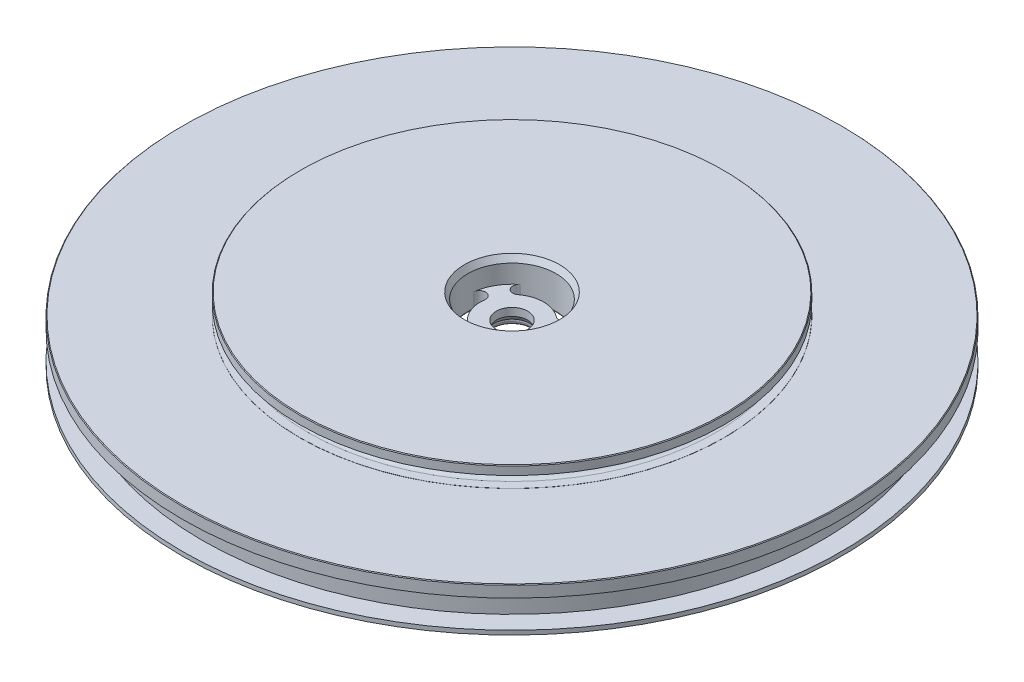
ISO-10303-21;
HEADER;
FILE_DESCRIPTION(('STEP AP214'),'2;1');
FILE_NAME('part.step','',(''),(''),'','','');
FILE_SCHEMA(('AUTOMOTIVE_DESIGN { 1 0 10303 214 1 1 1 1 }'));
ENDSEC;
DATA;
#1=APPLICATION_CONTEXT('core data for automotive mechanical design processes');
#2=APPLICATION_PROTOCOL_DEFINITION('international standard','automotive_design',2000,#1);
#3=PRODUCT_CONTEXT('',#1,'mechanical');
#4=PRODUCT('Part','Part','',(#3));
#5=PRODUCT_RELATED_PRODUCT_CATEGORY('part','',(#4));
#6=PRODUCT_DEFINITION_FORMATION('','',#4);
#7=PRODUCT_DEFINITION_CONTEXT('part definition',#1,'design');
#8=PRODUCT_DEFINITION('design','',#6,#7);
#9=PRODUCT_DEFINITION_SHAPE('','',#8);
#10=(LENGTH_UNIT() NAMED_UNIT(*) SI_UNIT(.MILLI.,.METRE.));
#11=(NAMED_UNIT(*) PLANE_ANGLE_UNIT() SI_UNIT($,.RADIAN.));
#12=(NAMED_UNIT(*) SI_UNIT($,.STERADIAN.) SOLID_ANGLE_UNIT());
#13=UNCERTAINTY_MEASURE_WITH_UNIT(LENGTH_MEASURE(1.E-05),#10,'distance_accuracy_value','');
#14=(GEOMETRIC_REPRESENTATION_CONTEXT(3) GLOBAL_UNCERTAINTY_ASSIGNED_CONTEXT((#13)) GLOBAL_UNIT_ASSIGNED_CONTEXT((#10,
#11,#12)) REPRESENTATION_CONTEXT('',''));
#15=CARTESIAN_POINT('',(0.,0.,0.));
#16=DIRECTION('',(0.,0.,1.));
#17=DIRECTION('',(1.,0.,0.));
#18=AXIS2_PLACEMENT_3D('',#15,#16,#17);
#19=CARTESIAN_POINT('',(-1.18300410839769E-12,0.135405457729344,21.884618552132));
#20=CARTESIAN_POINT('',(-2.86340456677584,0.135405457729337,21.8846185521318));
#21=CARTESIAN_POINT('',(-5.72944007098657,0.135405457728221,21.3145286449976));
#22=CARTESIAN_POINT('',(-11.0203218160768,0.135405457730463,19.1229736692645));
#23=CARTESIAN_POINT('',(-13.4500293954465,0.135405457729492,17.4994949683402));
#24=CARTESIAN_POINT('',(-17.499494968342,0.135405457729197,13.450029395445));
#25=CARTESIAN_POINT('',(-19.12297366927,0.135405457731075,11.0203218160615));
#26=CARTESIAN_POINT('',(-21.3145286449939,0.135405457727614,5.72944007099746));
#27=CARTESIAN_POINT('',(-21.884618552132,0.135405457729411,2.86340456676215));
#28=CARTESIAN_POINT('',(-21.8846185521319,0.135405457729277,-2.86340456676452));
#29=CARTESIAN_POINT('',(-21.3145286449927,0.135405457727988,-5.72944007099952));
#30=CARTESIAN_POINT('',(-19.1229736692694,0.135405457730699,-11.0203218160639));
#31=CARTESIAN_POINT('',(-17.4994949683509,0.135405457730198,-13.4500293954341));
#32=CARTESIAN_POINT('',(-13.4500293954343,0.135405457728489,-17.4994949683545));
#33=CARTESIAN_POINT('',(-11.0203218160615,0.135405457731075,-19.12297366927));
#34=CARTESIAN_POINT('',(-5.72944007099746,0.135405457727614,-21.3145286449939));
#35=CARTESIAN_POINT('',(-2.86340456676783,0.13540545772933,-21.8846185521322));
#36=CARTESIAN_POINT('',(2.86340456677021,0.135405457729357,-21.8846185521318));
#37=CARTESIAN_POINT('',(5.72944007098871,0.135405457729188,-21.3145286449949));
#38=CARTESIAN_POINT('',(11.0203218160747,0.135405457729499,-19.1229736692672));
#39=CARTESIAN_POINT('',(13.4500293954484,0.135405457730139,-17.4994949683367));
#40=CARTESIAN_POINT('',(17.4994949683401,0.135405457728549,-13.4500293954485));
#41=CARTESIAN_POINT('',(19.1229736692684,0.13540545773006,-11.02032181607));
#42=CARTESIAN_POINT('',(21.3145286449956,0.135405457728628,-5.72944007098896));
#43=CARTESIAN_POINT('',(21.884618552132,0.135405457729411,-2.86340456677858));
#44=CARTESIAN_POINT('',(21.8846185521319,0.135405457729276,2.86340456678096));
#45=CARTESIAN_POINT('',(21.3145286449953,0.135405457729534,5.72944007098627));
#46=CARTESIAN_POINT('',(19.1229736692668,0.135405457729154,11.0203218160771));
#47=CARTESIAN_POINT('',(17.4994949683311,0.13540545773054,13.4500293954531));
#48=CARTESIAN_POINT('',(13.4500293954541,0.135405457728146,17.4994949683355));
#49=CARTESIAN_POINT('',(11.0203218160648,0.135405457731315,19.1229736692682));
#50=CARTESIAN_POINT('',(5.72944007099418,0.135405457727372,21.3145286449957));
#51=CARTESIAN_POINT('',(2.86340456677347,0.135405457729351,21.8846185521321));
#52=CARTESIAN_POINT('',(-1.18300410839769E-12,0.135405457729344,21.884618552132));
#53=CARTESIAN_POINT('',(-1.20284898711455E-12,-0.0495618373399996,22.2049913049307));
#54=CARTESIAN_POINT('',(-2.90587174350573,-0.0495618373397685,22.2049913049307));
#55=CARTESIAN_POINT('',(-5.81280686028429,-0.0495618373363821,21.6267659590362));
#56=CARTESIAN_POINT('',(-11.1821577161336,-0.0495618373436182,19.4027080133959));
#57=CARTESIAN_POINT('',(-13.6465383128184,-0.0495618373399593,17.7560615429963));
#58=CARTESIAN_POINT('',(-17.7560615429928,-0.0495618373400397,13.6465383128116));
#59=CARTESIAN_POINT('',(-19.402708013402,-0.0495618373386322,11.1821577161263));
#60=CARTESIAN_POINT('',(-21.626765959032,-0.0495618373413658,5.81280686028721));
#61=CARTESIAN_POINT('',(-22.2049913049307,-0.0495618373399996,2.9058717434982));
#62=CARTESIAN_POINT('',(-22.2049913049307,-0.0495618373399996,-2.9058717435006));
#63=CARTESIAN_POINT('',(-21.6267659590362,-0.0495618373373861,-5.81280686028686));
#64=CARTESIAN_POINT('',(-19.4027080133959,-0.0495618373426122,-11.1821577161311));
#65=CARTESIAN_POINT('',(-17.7560615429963,-0.0495618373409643,-13.6465383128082));
#66=CARTESIAN_POINT('',(-13.6465383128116,-0.0495618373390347,-17.7560615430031));
#67=CARTESIAN_POINT('',(-11.1821577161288,-0.0495618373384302,-19.402708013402));
#68=CARTESIAN_POINT('',(-5.81280686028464,-0.0495618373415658,-21.626765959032));
#69=CARTESIAN_POINT('',(-2.90587174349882,-0.0495618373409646,-22.2049913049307));
#70=CARTESIAN_POINT('',(2.90587174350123,-0.049561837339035,-22.2049913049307));
#71=CARTESIAN_POINT('',(5.81280686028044,-0.0495618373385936,-21.6267659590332));
#72=CARTESIAN_POINT('',(11.1821577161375,-0.0495618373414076,-19.402708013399));
#73=CARTESIAN_POINT('',(13.6465383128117,-0.0495618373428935,-17.7560615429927));
#74=CARTESIAN_POINT('',(17.7560615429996,-0.0495618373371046,-13.6465383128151));
#75=CARTESIAN_POINT('',(19.4027080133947,-0.0495618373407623,-11.1821577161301));
#76=CARTESIAN_POINT('',(21.6267659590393,-0.0495618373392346,-5.81280686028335));
#77=CARTESIAN_POINT('',(22.2049913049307,-0.0495618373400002,-2.90587174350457));
#78=CARTESIAN_POINT('',(22.2049913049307,-0.0495618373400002,2.90587174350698));
#79=CARTESIAN_POINT('',(21.6267659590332,-0.0495618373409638,5.812806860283));
#80=CARTESIAN_POINT('',(19.402708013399,-0.0495618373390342,11.1821577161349));
#81=CARTESIAN_POINT('',(17.7560615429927,-0.0495618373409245,13.6465383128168));
#82=CARTESIAN_POINT('',(13.6465383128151,-0.0495618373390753,17.7560615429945));
#83=CARTESIAN_POINT('',(11.1821577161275,-0.0495618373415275,19.4027080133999));
#84=CARTESIAN_POINT('',(5.81280686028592,-0.0495618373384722,21.6267659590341));
#85=CARTESIAN_POINT('',(2.90587174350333,-0.0495618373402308,22.2049913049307));
#86=CARTESIAN_POINT('',(-1.20284898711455E-12,-0.0495618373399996,22.2049913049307));
#87=CARTESIAN_POINT('',(-1.22620457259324E-12,-0.0495618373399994,22.5749258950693));
#88=CARTESIAN_POINT('',(-2.95490861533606,-0.0495618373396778,22.5749258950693));
#89=CARTESIAN_POINT('',(-5.90907053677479,-0.0495618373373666,21.987306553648));
#90=CARTESIAN_POINT('',(-11.3690297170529,-0.0495618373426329,19.7257174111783));
#91=CARTESIAN_POINT('',(-13.8734472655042,-0.0495618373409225,18.0523191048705));
#92=CARTESIAN_POINT('',(-18.0523191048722,-0.0495618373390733,13.8734472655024));
#93=CARTESIAN_POINT('',(-19.7257174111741,-0.0495618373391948,11.3690297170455));
#94=CARTESIAN_POINT('',(-21.987306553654,-0.0495618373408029,5.90907053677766));
#95=CARTESIAN_POINT('',(-22.5749258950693,-0.0495618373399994,2.95490861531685));
#96=CARTESIAN_POINT('',(-22.5749258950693,-0.0495618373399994,-2.9549086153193));
#97=CARTESIAN_POINT('',(-21.9873065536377,-0.049561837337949,-5.9090705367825));
#98=CARTESIAN_POINT('',(-19.7257174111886,-0.0495618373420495,-11.3690297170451));
#99=CARTESIAN_POINT('',(-18.0523191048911,-0.0495618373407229,-13.8734472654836));
#100=CARTESIAN_POINT('',(-13.8734472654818,-0.0495618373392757,-18.0523191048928));
#101=CARTESIAN_POINT('',(-11.369029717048,-0.0495618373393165,-19.7257174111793));
#102=CARTESIAN_POINT('',(-5.90907053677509,-0.0495618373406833,-21.9873065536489));
#103=CARTESIAN_POINT('',(-2.95490861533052,-0.0495618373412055,-22.5749258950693));
#104=CARTESIAN_POINT('',(2.95490861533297,-0.0495618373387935,-22.5749258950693));
#105=CARTESIAN_POINT('',(5.90907053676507,-0.0495618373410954,-21.9873065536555));
#106=CARTESIAN_POINT('',(11.3690297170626,-0.0495618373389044,-19.7257174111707));
#107=CARTESIAN_POINT('',(13.8734472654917,-0.0495618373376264,-18.0523191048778));
#108=CARTESIAN_POINT('',(18.0523191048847,-0.0495618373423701,-13.8734472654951));
#109=CARTESIAN_POINT('',(19.7257174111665,-0.049561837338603,-11.3690297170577));
#110=CARTESIAN_POINT('',(21.9873065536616,-0.049561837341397,-5.90907053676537));
#111=CARTESIAN_POINT('',(22.5749258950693,-0.0495618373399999,-2.95490861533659));
#112=CARTESIAN_POINT('',(22.5749258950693,-0.0495618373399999,2.95490861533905));
#113=CARTESIAN_POINT('',(21.9873065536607,-0.049561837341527,5.90907053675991));
#114=CARTESIAN_POINT('',(19.7257174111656,-0.0495618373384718,11.3690297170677));
#115=CARTESIAN_POINT('',(18.0523191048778,-0.0495618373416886,13.8734472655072));
#116=CARTESIAN_POINT('',(13.8734472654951,-0.0495618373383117,18.0523191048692));
#117=CARTESIAN_POINT('',(11.3690297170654,-0.0495618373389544,19.7257174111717));
#118=CARTESIAN_POINT('',(5.90907053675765,-0.0495618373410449,21.9873065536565));
#119=CARTESIAN_POINT('',(2.9549086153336,-0.049561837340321,22.5749258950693));
#120=CARTESIAN_POINT('',(-1.22620457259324E-12,-0.0495618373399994,22.5749258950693));
#121=CARTESIAN_POINT('',(-1.2460494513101E-12,0.135405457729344,22.895298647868));
#122=CARTESIAN_POINT('',(-2.99737579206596,0.135405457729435,22.895298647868));
#123=CARTESIAN_POINT('',(-5.99243732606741,0.135405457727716,22.2995438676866));
#124=CARTESIAN_POINT('',(-11.5308656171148,0.135405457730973,20.0054517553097));
#125=CARTESIAN_POINT('',(-14.0699561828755,0.13540545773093,18.308885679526));
#126=CARTESIAN_POINT('',(-18.3088856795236,0.135405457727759,14.0699561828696));
#127=CARTESIAN_POINT('',(-20.0054517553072,0.135405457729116,11.5308656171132));
#128=CARTESIAN_POINT('',(-22.299543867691,0.135405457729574,5.99243732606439));
#129=CARTESIAN_POINT('',(-22.8952986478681,0.135405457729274,2.99737579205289));
#130=CARTESIAN_POINT('',(-22.895298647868,0.135405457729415,-2.99737579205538));
#131=CARTESIAN_POINT('',(-22.2995438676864,0.135405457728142,-5.99243732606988));
#132=CARTESIAN_POINT('',(-20.0054517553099,0.135405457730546,-11.5308656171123));
#133=CARTESIAN_POINT('',(-18.3088856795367,0.135405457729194,-14.0699561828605));
#134=CARTESIAN_POINT('',(-14.0699561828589,0.135405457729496,-18.3088856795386));
#135=CARTESIAN_POINT('',(-11.5308656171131,0.135405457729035,-20.0054517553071));
#136=CARTESIAN_POINT('',(-5.99243732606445,0.135405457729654,-22.2995438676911));
#137=CARTESIAN_POINT('',(-2.99737579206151,0.135405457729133,-22.8952986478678));
#138=CARTESIAN_POINT('',(2.99737579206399,0.135405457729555,-22.8952986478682));
#139=CARTESIAN_POINT('',(5.99243732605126,0.135405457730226,-22.299543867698));
#140=CARTESIAN_POINT('',(11.5308656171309,0.135405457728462,-20.0054517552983));
#141=CARTESIAN_POINT('',(14.0699561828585,0.135405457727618,-18.3088856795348));
#142=CARTESIAN_POINT('',(18.3088856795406,0.135405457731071,-14.0699561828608));
#143=CARTESIAN_POINT('',(20.0054517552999,0.135405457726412,-11.5308656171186));
#144=CARTESIAN_POINT('',(22.2995438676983,0.135405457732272,-5.99243732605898));
#145=CARTESIAN_POINT('',(22.8952986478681,0.135405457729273,-2.99737579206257));
#146=CARTESIAN_POINT('',(22.895298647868,0.135405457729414,2.99737579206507));
#147=CARTESIAN_POINT('',(22.2995438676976,0.13540545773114,5.99243732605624));
#148=CARTESIAN_POINT('',(20.0054517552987,0.135405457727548,11.5308656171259));
#149=CARTESIAN_POINT('',(18.308885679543,0.135405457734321,14.0699561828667));
#150=CARTESIAN_POINT('',(14.0699561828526,0.135405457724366,18.3088856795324));
#151=CARTESIAN_POINT('',(11.5308656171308,0.135405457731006,20.0054517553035));
#152=CARTESIAN_POINT('',(5.99243732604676,0.135405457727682,22.2995438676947));
#153=CARTESIAN_POINT('',(2.99737579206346,0.135405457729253,22.895298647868));
#154=CARTESIAN_POINT('',(-1.2460494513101E-12,0.135405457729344,22.895298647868));
#155=(BOUNDED_SURFACE() B_SPLINE_SURFACE(3,3,((#19,#20,#21,#22,#23,#24,#25,#26,#27,#28,#29,#30,
#31,#32,#33,#34,#35,#36,#37,#38,#39,#40,#41,#42,#43,#44,#45,#46,#47,#48,#49,#50,#51,#52),(#53,
#54,#55,#56,#57,#58,#59,#60,#61,#62,#63,#64,#65,#66,#67,#68,#69,#70,#71,#72,#73,#74,#75,#76,#77,
#78,#79,#80,#81,#82,#83,#84,#85,#86),(#87,#88,#89,#90,#91,#92,#93,#94,#95,#96,#97,#98,#99,#100,
#101,#102,#103,#104,#105,#106,#107,#108,#109,#110,#111,#112,#113,#114,#115,#116,#117,#118,#119,
#120),(#121,#122,#123,#124,#125,#126,#127,#128,#129,#130,#131,#132,#133,#134,#135,#136,#137,
#138,#139,#140,#141,#142,#143,#144,#145,#146,#147,#148,#149,#150,#151,#152,#153,#154)),
.UNSPECIFIED.,.F.,.T.,.F.) B_SPLINE_SURFACE_WITH_KNOTS((4,4),(4,2,2,2,2,2,2,2,2,2,2,2,2,2,2,2,
4),(0.,1.),(0.500000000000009,0.562500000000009,0.625000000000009,0.687500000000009,
0.750000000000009,0.812500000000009,0.875000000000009,0.937500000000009,1.00000000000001,
1.06250000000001,1.12500000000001,1.18750000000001,1.25000000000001,1.31250000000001,
1.37500000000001,1.43750000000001,1.50000000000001),
.UNSPECIFIED.) GEOMETRIC_REPRESENTATION_ITEM() RATIONAL_B_SPLINE_SURFACE(((1.,1.,1.,1.,1.,1.,1.,
1.,1.,1.,1.,1.,1.,1.,1.,1.,1.,1.,1.,1.,1.,1.,1.,1.,1.,1.,1.,1.,1.,1.,1.,1.,1.,1.),
(0.910683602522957,0.910683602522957,0.910683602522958,0.910683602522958,0.910683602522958,
0.910683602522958,0.910683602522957,0.910683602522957,0.910683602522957,0.910683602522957,
0.910683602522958,0.910683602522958,0.910683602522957,0.910683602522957,0.910683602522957,
0.910683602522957,0.910683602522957,0.910683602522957,0.910683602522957,0.910683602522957,
0.910683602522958,0.910683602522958,0.910683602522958,0.910683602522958,0.910683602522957,
0.910683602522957,0.910683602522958,0.910683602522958,0.910683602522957,0.910683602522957,
0.910683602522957,0.910683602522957,0.910683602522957,0.910683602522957),(0.910683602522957,
0.910683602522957,0.910683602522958,0.910683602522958,0.910683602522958,0.910683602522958,
0.910683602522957,0.910683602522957,0.910683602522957,0.910683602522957,0.910683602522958,
0.910683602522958,0.910683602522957,0.910683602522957,0.910683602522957,0.910683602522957,
0.910683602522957,0.910683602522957,0.910683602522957,0.910683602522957,0.910683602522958,
0.910683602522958,0.910683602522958,0.910683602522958,0.910683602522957,0.910683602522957,
0.910683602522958,0.910683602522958,0.910683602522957,0.910683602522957,0.910683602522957,
0.910683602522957,0.910683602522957,0.910683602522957),(1.,1.,1.,1.,1.,1.,1.,1.,1.,1.,1.,1.,1.,
1.,1.,1.,1.,1.,1.,1.,1.,1.,1.,1.,1.,1.,1.,1.,1.,1.,1.,1.,1.,1.))) REPRESENTATION_ITEM('') SURFACE());
#156=CARTESIAN_POINT('',(-1.2460494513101E-12,0.135405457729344,22.895298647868));
#157=CARTESIAN_POINT('',(-2.99737579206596,0.135405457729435,22.895298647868));
#158=CARTESIAN_POINT('',(-5.99243732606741,0.135405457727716,22.2995438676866));
#159=CARTESIAN_POINT('',(-11.5308656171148,0.135405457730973,20.0054517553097));
#160=CARTESIAN_POINT('',(-14.0699561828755,0.13540545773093,18.308885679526));
#161=CARTESIAN_POINT('',(-18.3088856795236,0.135405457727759,14.0699561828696));
#162=CARTESIAN_POINT('',(-20.0054517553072,0.135405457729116,11.5308656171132));
#163=CARTESIAN_POINT('',(-22.299543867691,0.135405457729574,5.99243732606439));
#164=CARTESIAN_POINT('',(-22.8952986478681,0.135405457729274,2.99737579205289));
#165=CARTESIAN_POINT('',(-22.895298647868,0.135405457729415,-2.99737579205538));
#166=CARTESIAN_POINT('',(-22.2995438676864,0.135405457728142,-5.99243732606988));
#167=CARTESIAN_POINT('',(-20.0054517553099,0.135405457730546,-11.5308656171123));
#168=CARTESIAN_POINT('',(-18.3088856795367,0.135405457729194,-14.0699561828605));
#169=CARTESIAN_POINT('',(-14.0699561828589,0.135405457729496,-18.3088856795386));
#170=CARTESIAN_POINT('',(-11.5308656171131,0.135405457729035,-20.0054517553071));
#171=CARTESIAN_POINT('',(-5.99243732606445,0.135405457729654,-22.2995438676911));
#172=CARTESIAN_POINT('',(-2.99737579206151,0.135405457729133,-22.8952986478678));
#173=CARTESIAN_POINT('',(2.99737579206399,0.135405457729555,-22.8952986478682));
#174=CARTESIAN_POINT('',(5.99243732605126,0.135405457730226,-22.299543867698));
#175=CARTESIAN_POINT('',(11.5308656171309,0.135405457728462,-20.0054517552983));
#176=CARTESIAN_POINT('',(14.0699561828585,0.135405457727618,-18.3088856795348));
#177=CARTESIAN_POINT('',(18.3088856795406,0.135405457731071,-14.0699561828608));
#178=CARTESIAN_POINT('',(20.0054517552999,0.135405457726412,-11.5308656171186));
#179=CARTESIAN_POINT('',(22.2995438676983,0.135405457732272,-5.99243732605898));
#180=CARTESIAN_POINT('',(22.8952986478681,0.135405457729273,-2.99737579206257));
#181=CARTESIAN_POINT('',(22.895298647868,0.135405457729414,2.99737579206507));
#182=CARTESIAN_POINT('',(22.2995438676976,0.13540545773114,5.99243732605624));
#183=CARTESIAN_POINT('',(20.0054517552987,0.135405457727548,11.5308656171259));
#184=CARTESIAN_POINT('',(18.308885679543,0.135405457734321,14.0699561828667));
#185=CARTESIAN_POINT('',(14.0699561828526,0.135405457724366,18.3088856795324));
#186=CARTESIAN_POINT('',(11.5308656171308,0.135405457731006,20.0054517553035));
#187=CARTESIAN_POINT('',(5.99243732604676,0.135405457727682,22.2995438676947));
#188=CARTESIAN_POINT('',(2.99737579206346,0.135405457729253,22.895298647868));
#189=CARTESIAN_POINT('',(-1.2460494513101E-12,0.135405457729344,22.895298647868));
#190=(BOUNDED_CURVE() B_SPLINE_CURVE(3,(#156,#157,#158,#159,#160,#161,#162,#163,#164,#165,#166,
#167,#168,#169,#170,#171,#172,#173,#174,#175,#176,#177,#178,#179,#180,#181,#182,#183,#184,#185,
#186,#187,#188,#189),.UNSPECIFIED.,.T.,.F.) B_SPLINE_CURVE_WITH_KNOTS((4,2,2,2,2,2,2,2,2,2,2,2,
2,2,2,2,4),(0.500000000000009,0.562500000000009,0.625000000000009,0.687500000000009,
0.750000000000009,0.812500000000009,0.875000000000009,0.937500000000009,1.00000000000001,
1.06250000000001,1.12500000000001,1.18750000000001,1.25000000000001,1.31250000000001,
1.37500000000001,1.43750000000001,1.50000000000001),
.UNSPECIFIED.) CURVE() GEOMETRIC_REPRESENTATION_ITEM() RATIONAL_B_SPLINE_CURVE((1.,1.,1.,1.,1.,
1.,1.,1.,1.,1.,1.,1.,1.,1.,1.,1.,1.,1.,1.,1.,1.,1.,1.,1.,1.,1.,1.,1.,1.,1.,1.,1.,1.,1.)) REPRESENTATION_ITEM(''));
#191=CARTESIAN_POINT('',(-1.2460494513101E-12,0.135405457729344,22.895298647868));
#192=VERTEX_POINT('',#191);
#193=EDGE_CURVE('E407',#192,#192,#190,.F.);
#194=CARTESIAN_POINT('',(-1.18300410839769E-12,0.135405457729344,21.884618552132));
#195=CARTESIAN_POINT('',(2.86340456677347,0.135405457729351,21.8846185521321));
#196=CARTESIAN_POINT('',(5.72944007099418,0.135405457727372,21.3145286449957));
#197=CARTESIAN_POINT('',(11.0203218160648,0.135405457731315,19.1229736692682));
#198=CARTESIAN_POINT('',(13.4500293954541,0.135405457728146,17.4994949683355));
#199=CARTESIAN_POINT('',(17.4994949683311,0.13540545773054,13.4500293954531));
#200=CARTESIAN_POINT('',(19.1229736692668,0.135405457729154,11.0203218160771));
#201=CARTESIAN_POINT('',(21.3145286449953,0.135405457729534,5.72944007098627));
#202=CARTESIAN_POINT('',(21.8846185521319,0.135405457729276,2.86340456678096));
#203=CARTESIAN_POINT('',(21.884618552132,0.135405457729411,-2.86340456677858));
#204=CARTESIAN_POINT('',(21.3145286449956,0.135405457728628,-5.72944007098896));
#205=CARTESIAN_POINT('',(19.1229736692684,0.13540545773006,-11.02032181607));
#206=CARTESIAN_POINT('',(17.4994949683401,0.135405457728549,-13.4500293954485));
#207=CARTESIAN_POINT('',(13.4500293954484,0.135405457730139,-17.4994949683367));
#208=CARTESIAN_POINT('',(11.0203218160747,0.135405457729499,-19.1229736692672));
#209=CARTESIAN_POINT('',(5.72944007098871,0.135405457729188,-21.3145286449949));
#210=CARTESIAN_POINT('',(2.86340456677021,0.135405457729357,-21.8846185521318));
#211=CARTESIAN_POINT('',(-2.86340456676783,0.13540545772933,-21.8846185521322));
#212=CARTESIAN_POINT('',(-5.72944007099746,0.135405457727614,-21.3145286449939));
#213=CARTESIAN_POINT('',(-11.0203218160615,0.135405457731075,-19.12297366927));
#214=CARTESIAN_POINT('',(-13.4500293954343,0.135405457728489,-17.4994949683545));
#215=CARTESIAN_POINT('',(-17.4994949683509,0.135405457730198,-13.4500293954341));
#216=CARTESIAN_POINT('',(-19.1229736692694,0.135405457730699,-11.0203218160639));
#217=CARTESIAN_POINT('',(-21.3145286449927,0.135405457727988,-5.72944007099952));
#218=CARTESIAN_POINT('',(-21.8846185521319,0.135405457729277,-2.86340456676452));
#219=CARTESIAN_POINT('',(-21.884618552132,0.135405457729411,2.86340456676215));
#220=CARTESIAN_POINT('',(-21.3145286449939,0.135405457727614,5.72944007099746));
#221=CARTESIAN_POINT('',(-19.12297366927,0.135405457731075,11.0203218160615));
#222=CARTESIAN_POINT('',(-17.499494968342,0.135405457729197,13.450029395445));
#223=CARTESIAN_POINT('',(-13.4500293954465,0.135405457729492,17.4994949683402));
#224=CARTESIAN_POINT('',(-11.0203218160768,0.135405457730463,19.1229736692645));
#225=CARTESIAN_POINT('',(-5.72944007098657,0.135405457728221,21.3145286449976));
#226=CARTESIAN_POINT('',(-2.86340456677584,0.135405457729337,21.8846185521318));
#227=CARTESIAN_POINT('',(-1.18300410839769E-12,0.135405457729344,21.884618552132));
#228=(BOUNDED_CURVE() B_SPLINE_CURVE(3,(#194,#195,#196,#197,#198,#199,#200,#201,#202,#203,#204,
#205,#206,#207,#208,#209,#210,#211,#212,#213,#214,#215,#216,#217,#218,#219,#220,#221,#222,#223,
#224,#225,#226,#227),.UNSPECIFIED.,.T.,.F.) B_SPLINE_CURVE_WITH_KNOTS((4,2,2,2,2,2,2,2,2,2,2,2,
2,2,2,2,4),(0.500000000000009,0.562500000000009,0.625000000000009,0.687500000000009,
0.750000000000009,0.812500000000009,0.875000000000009,0.937500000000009,1.00000000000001,
1.06250000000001,1.12500000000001,1.18750000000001,1.25000000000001,1.31250000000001,
1.37500000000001,1.43750000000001,1.50000000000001),
.UNSPECIFIED.) CURVE() GEOMETRIC_REPRESENTATION_ITEM() RATIONAL_B_SPLINE_CURVE((1.,1.,1.,1.,1.,
1.,1.,1.,1.,1.,1.,1.,1.,1.,1.,1.,1.,1.,1.,1.,1.,1.,1.,1.,1.,1.,1.,1.,1.,1.,1.,1.,1.,1.)) REPRESENTATION_ITEM(''));
#229=CARTESIAN_POINT('',(-1.18300410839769E-12,0.135405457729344,21.884618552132));
#230=VERTEX_POINT('',#229);
#231=EDGE_CURVE('E464',#230,#230,#228,.F.);
#232=ORIENTED_EDGE('',*,*,#193,.F.);
#233=EDGE_LOOP('',(#232));
#234=FACE_BOUND('',#233,.T.);
#235=ORIENTED_EDGE('',*,*,#231,.F.);
#236=EDGE_LOOP('',(#235));
#237=FACE_BOUND('',#236,.T.);
#238=ADVANCED_FACE('F47',(#234,#237),#155,.T.);
#239=CARTESIAN_POINT('',(0.,33.9223684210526,0.));
#240=DIRECTION('',(0.,1.,0.));
#241=DIRECTION('',(0.,0.,1.));
#242=AXIS2_PLACEMENT_3D('',#239,#240,#241);
#243=CYLINDRICAL_SURFACE('',#242,15.25);
#244=CARTESIAN_POINT('',(0.,3.76,0.));
#245=DIRECTION('',(0.,-1.,0.));
#246=DIRECTION('',(0.,0.,-1.));
#247=AXIS2_PLACEMENT_3D('',#244,#245,#246);
#248=CIRCLE('',#247,15.25);
#249=CARTESIAN_POINT('',(0.,3.76,-15.25));
#250=VERTEX_POINT('',#249);
#251=EDGE_CURVE('E350',#250,#250,#248,.T.);
#252=ORIENTED_EDGE('',*,*,#251,.T.);
#253=EDGE_LOOP('',(#252));
#254=FACE_BOUND('',#253,.T.);
#255=CARTESIAN_POINT('',(0.,3.75,0.));
#256=DIRECTION('',(0.,1.,0.));
#257=DIRECTION('',(0.,0.,1.));
#258=AXIS2_PLACEMENT_3D('',#255,#256,#257);
#259=CIRCLE('',#258,15.25);
#260=CARTESIAN_POINT('',(0.,3.75,15.25));
#261=VERTEX_POINT('',#260);
#262=EDGE_CURVE('E515',#261,#261,#259,.T.);
#263=ORIENTED_EDGE('',*,*,#262,.T.);
#264=EDGE_LOOP('',(#263));
#265=FACE_BOUND('',#264,.T.);
#266=ADVANCED_FACE('F440',(#254,#265),#243,.T.);
#267=CARTESIAN_POINT('',(0.,33.9223684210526,0.));
#268=DIRECTION('',(0.,1.,0.));
#269=DIRECTION('',(0.,0.,1.));
#270=AXIS2_PLACEMENT_3D('',#267,#268,#269);
#271=CYLINDRICAL_SURFACE('',#270,1.1303);
#272=CARTESIAN_POINT('',(0.,2.89082013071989,0.));
#273=DIRECTION('',(0.,-1.,0.));
#274=DIRECTION('',(0.,0.,-1.));
#275=AXIS2_PLACEMENT_3D('',#272,#273,#274);
#276=CIRCLE('',#275,1.1303);
#277=CARTESIAN_POINT('',(0.,2.89082013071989,-1.1303));
#278=VERTEX_POINT('',#277);
#279=EDGE_CURVE('E243',#278,#278,#276,.T.);
#280=ORIENTED_EDGE('',*,*,#279,.T.);
#281=EDGE_LOOP('',(#280));
#282=FACE_BOUND('',#281,.T.);
#283=CARTESIAN_POINT('',(0.,3.45,0.));
#284=DIRECTION('',(0.,1.,0.));
#285=DIRECTION('',(0.,0.,1.));
#286=AXIS2_PLACEMENT_3D('',#283,#284,#285);
#287=CIRCLE('',#286,1.1303);
#288=CARTESIAN_POINT('',(0.,3.45,1.1303));
#289=VERTEX_POINT('',#288);
#290=EDGE_CURVE('E221',#289,#289,#287,.T.);
#291=ORIENTED_EDGE('',*,*,#290,.T.);
#292=EDGE_LOOP('',(#291));
#293=FACE_BOUND('',#292,.T.);
#294=ADVANCED_FACE('F711',(#282,#293),#271,.F.);
#295=CARTESIAN_POINT('',(1.65887489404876,0.,-2.16188785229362));
#296=DIRECTION('',(0.,1.,0.));
#297=DIRECTION('',(0.,0.,1.));
#298=AXIS2_PLACEMENT_3D('',#295,#296,#297);
#299=CYLINDRICAL_SURFACE('',#298,0.45);
#300=DIRECTION('',(0.,1.,0.));
#301=VECTOR('',#300,1.);
#302=CARTESIAN_POINT('',(1.93281753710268,0.,-2.51889685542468));
#303=LINE('',#302,#301);
#304=CARTESIAN_POINT('',(1.93281753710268,2.43,-2.51889685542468));
#305=VERTEX_POINT('',#304);
#306=CARTESIAN_POINT('',(1.93281753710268,3.45,-2.51889685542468));
#307=VERTEX_POINT('',#306);
#308=EDGE_CURVE('E545',#305,#307,#303,.T.);
#309=ORIENTED_EDGE('',*,*,#308,.F.);
#310=CARTESIAN_POINT('',(1.65887489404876,2.43,-2.16188785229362));
#311=DIRECTION('',(0.,-1.,0.));
#312=DIRECTION('',(0.,0.,-1.));
#313=AXIS2_PLACEMENT_3D('',#310,#311,#312);
#314=CIRCLE('',#313,0.45);
#315=CARTESIAN_POINT('',(1.38493225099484,2.43,-1.80487884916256));
#316=VERTEX_POINT('',#315);
#317=EDGE_CURVE('E306',#305,#316,#314,.T.);
#318=ORIENTED_EDGE('',*,*,#317,.T.);
#319=DIRECTION('',(0.,1.,0.));
#320=VECTOR('',#319,1.);
#321=CARTESIAN_POINT('',(1.38493225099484,0.,-1.80487884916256));
#322=LINE('',#321,#320);
#323=CARTESIAN_POINT('',(1.38493225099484,3.45,-1.80487884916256));
#324=VERTEX_POINT('',#323);
#325=EDGE_CURVE('E533',#316,#324,#322,.T.);
#326=ORIENTED_EDGE('',*,*,#325,.T.);
#327=CARTESIAN_POINT('',(1.65887489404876,3.45,-2.16188785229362));
#328=DIRECTION('',(0.,1.,0.));
#329=DIRECTION('',(0.,0.,1.));
#330=AXIS2_PLACEMENT_3D('',#327,#328,#329);
#331=CIRCLE('',#330,0.45);
#332=EDGE_CURVE('E590',#307,#324,#331,.F.);
#333=ORIENTED_EDGE('',*,*,#332,.F.);
#334=EDGE_LOOP('',(#309,#318,#326,#333));
#335=FACE_BOUND('',#334,.T.);
#336=ADVANCED_FACE('F634',(#335),#299,.F.);
#337=CARTESIAN_POINT('',(0.,0.,0.));
#338=DIRECTION('',(0.,1.,0.));
#339=DIRECTION('',(0.,0.,1.));
#340=AXIS2_PLACEMENT_3D('',#337,#338,#339);
#341=CYLINDRICAL_SURFACE('',#340,2.275);
#342=ORIENTED_EDGE('',*,*,#325,.F.);
#343=CARTESIAN_POINT('',(0.,2.43,0.));
#344=DIRECTION('',(0.,-1.,0.));
#345=DIRECTION('',(0.,0.,-1.));
#346=AXIS2_PLACEMENT_3D('',#343,#344,#345);
#347=CIRCLE('',#346,2.275);
#348=CARTESIAN_POINT('',(-1.38493225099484,2.43,-1.80487884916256));
#349=VERTEX_POINT('',#348);
#350=EDGE_CURVE('E316',#316,#349,#347,.F.);
#351=ORIENTED_EDGE('',*,*,#350,.T.);
#352=DIRECTION('',(0.,1.,0.));
#353=VECTOR('',#352,1.);
#354=CARTESIAN_POINT('',(-1.38493225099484,0.,-1.80487884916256));
#355=LINE('',#354,#353);
#356=CARTESIAN_POINT('',(-1.38493225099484,3.45,-1.80487884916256));
#357=VERTEX_POINT('',#356);
#358=EDGE_CURVE('E537',#349,#357,#355,.T.);
#359=ORIENTED_EDGE('',*,*,#358,.T.);
#360=CARTESIAN_POINT('',(0.,3.45,0.));
#361=DIRECTION('',(0.,1.,0.));
#362=DIRECTION('',(0.,0.,1.));
#363=AXIS2_PLACEMENT_3D('',#360,#361,#362);
#364=CIRCLE('',#363,2.275);
#365=EDGE_CURVE('E594',#324,#357,#364,.T.);
#366=ORIENTED_EDGE('',*,*,#365,.F.);
#367=EDGE_LOOP('',(#342,#351,#359,#366));
#368=FACE_BOUND('',#367,.T.);
#369=ADVANCED_FACE('F639',(#368),#341,.T.);
#370=CARTESIAN_POINT('',(-1.65887489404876,0.,-2.16188785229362));
#371=DIRECTION('',(0.,1.,0.));
#372=DIRECTION('',(0.,0.,1.));
#373=AXIS2_PLACEMENT_3D('',#370,#371,#372);
#374=CYLINDRICAL_SURFACE('',#373,0.45);
#375=ORIENTED_EDGE('',*,*,#358,.F.);
#376=CARTESIAN_POINT('',(-1.65887489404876,2.43,-2.16188785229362));
#377=DIRECTION('',(0.,-1.,0.));
#378=DIRECTION('',(0.,0.,-1.));
#379=AXIS2_PLACEMENT_3D('',#376,#377,#378);
#380=CIRCLE('',#379,0.45);
#381=CARTESIAN_POINT('',(-1.93281753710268,2.43,-2.51889685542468));
#382=VERTEX_POINT('',#381);
#383=EDGE_CURVE('E302',#349,#382,#380,.T.);
#384=ORIENTED_EDGE('',*,*,#383,.T.);
#385=DIRECTION('',(0.,1.,0.));
#386=VECTOR('',#385,1.);
#387=CARTESIAN_POINT('',(-1.93281753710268,0.,-2.51889685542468));
#388=LINE('',#387,#386);
#389=CARTESIAN_POINT('',(-1.93281753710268,3.45,-2.51889685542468));
#390=VERTEX_POINT('',#389);
#391=EDGE_CURVE('E541',#382,#390,#388,.T.);
#392=ORIENTED_EDGE('',*,*,#391,.T.);
#393=CARTESIAN_POINT('',(-1.65887489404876,3.45,-2.16188785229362));
#394=DIRECTION('',(0.,1.,0.));
#395=DIRECTION('',(0.,0.,1.));
#396=AXIS2_PLACEMENT_3D('',#393,#394,#395);
#397=CIRCLE('',#396,0.45);
#398=EDGE_CURVE('E599',#357,#390,#397,.F.);
#399=ORIENTED_EDGE('',*,*,#398,.F.);
#400=EDGE_LOOP('',(#375,#384,#392,#399));
#401=FACE_BOUND('',#400,.T.);
#402=ADVANCED_FACE('F657',(#401),#374,.F.);
#403=CARTESIAN_POINT('',(-2.70168724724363,0.,-0.35568387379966));
#404=DIRECTION('',(0.,1.,0.));
#405=DIRECTION('',(0.,0.,1.));
#406=AXIS2_PLACEMENT_3D('',#403,#404,#405);
#407=CYLINDRICAL_SURFACE('',#406,0.45);
#408=DIRECTION('',(0.,1.,0.));
#409=VECTOR('',#408,1.);
#410=CARTESIAN_POINT('',(-3.14783743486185,0.,-0.414420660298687));
#411=LINE('',#410,#409);
#412=CARTESIAN_POINT('',(-3.14783743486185,2.43,-0.414420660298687));
#413=VERTEX_POINT('',#412);
#414=CARTESIAN_POINT('',(-3.14783743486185,3.45,-0.414420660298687));
#415=VERTEX_POINT('',#414);
#416=EDGE_CURVE('E185',#413,#415,#411,.T.);
#417=ORIENTED_EDGE('',*,*,#416,.F.);
#418=CARTESIAN_POINT('',(-2.70168724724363,2.43,-0.35568387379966));
#419=DIRECTION('',(0.,-1.,0.));
#420=DIRECTION('',(0.,0.,-1.));
#421=AXIS2_PLACEMENT_3D('',#418,#419,#420);
#422=CIRCLE('',#421,0.45);
#423=CARTESIAN_POINT('',(-2.25553705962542,2.43,-0.296947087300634));
#424=VERTEX_POINT('',#423);
#425=EDGE_CURVE('E63',#413,#424,#422,.T.);
#426=ORIENTED_EDGE('',*,*,#425,.T.);
#427=DIRECTION('',(0.,1.,0.));
#428=VECTOR('',#427,1.);
#429=CARTESIAN_POINT('',(-2.25553705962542,0.,-0.296947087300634));
#430=LINE('',#429,#428);
#431=CARTESIAN_POINT('',(-2.25553705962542,3.45,-0.296947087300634));
#432=VERTEX_POINT('',#431);
#433=EDGE_CURVE('E564',#424,#432,#430,.T.);
#434=ORIENTED_EDGE('',*,*,#433,.T.);
#435=CARTESIAN_POINT('',(-2.70168724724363,3.45,-0.35568387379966));
#436=DIRECTION('',(0.,1.,0.));
#437=DIRECTION('',(0.,0.,1.));
#438=AXIS2_PLACEMENT_3D('',#435,#436,#437);
#439=CIRCLE('',#438,0.45);
#440=EDGE_CURVE('E604',#415,#432,#439,.F.);
#441=ORIENTED_EDGE('',*,*,#440,.F.);
#442=EDGE_LOOP('',(#417,#426,#434,#441));
#443=FACE_BOUND('',#442,.T.);
#444=ADVANCED_FACE('F1167',(#443),#407,.F.);
#445=CARTESIAN_POINT('',(0.,0.,0.));
#446=DIRECTION('',(0.,1.,0.));
#447=DIRECTION('',(0.,0.,1.));
#448=AXIS2_PLACEMENT_3D('',#445,#446,#447);
#449=CYLINDRICAL_SURFACE('',#448,2.275);
#450=ORIENTED_EDGE('',*,*,#433,.F.);
#451=CARTESIAN_POINT('',(0.,2.43,0.));
#452=DIRECTION('',(0.,-1.,0.));
#453=DIRECTION('',(0.,0.,-1.));
#454=AXIS2_PLACEMENT_3D('',#451,#452,#453);
#455=CIRCLE('',#454,2.275);
#456=CARTESIAN_POINT('',(-0.870604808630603,2.43,2.10182593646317));
#457=VERTEX_POINT('',#456);
#458=EDGE_CURVE('E70',#424,#457,#455,.F.);
#459=ORIENTED_EDGE('',*,*,#458,.T.);
#460=DIRECTION('',(0.,1.,0.));
#461=VECTOR('',#460,1.);
#462=CARTESIAN_POINT('',(-0.870604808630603,0.,2.10182593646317));
#463=LINE('',#462,#461);
#464=CARTESIAN_POINT('',(-0.870604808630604,3.45,2.10182593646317));
#465=VERTEX_POINT('',#464);
#466=EDGE_CURVE('E184',#457,#465,#463,.T.);
#467=ORIENTED_EDGE('',*,*,#466,.T.);
#468=CARTESIAN_POINT('',(0.,3.45,0.));
#469=DIRECTION('',(0.,1.,0.));
#470=DIRECTION('',(0.,0.,1.));
#471=AXIS2_PLACEMENT_3D('',#468,#469,#470);
#472=CIRCLE('',#471,2.275);
#473=EDGE_CURVE('E197',#432,#465,#472,.T.);
#474=ORIENTED_EDGE('',*,*,#473,.F.);
#475=EDGE_LOOP('',(#450,#459,#467,#474));
#476=FACE_BOUND('',#475,.T.);
#477=ADVANCED_FACE('F1159',(#476),#449,.T.);
#478=CARTESIAN_POINT('',(-1.0428123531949,0.,2.51757172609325));
#479=DIRECTION('',(0.,1.,0.));
#480=DIRECTION('',(0.,0.,1.));
#481=AXIS2_PLACEMENT_3D('',#478,#479,#480);
#482=CYLINDRICAL_SURFACE('',#481,0.45);
#483=ORIENTED_EDGE('',*,*,#466,.F.);
#484=CARTESIAN_POINT('',(-1.0428123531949,2.43,2.51757172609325));
#485=DIRECTION('',(0.,-1.,0.));
#486=DIRECTION('',(0.,0.,-1.));
#487=AXIS2_PLACEMENT_3D('',#484,#485,#486);
#488=CIRCLE('',#487,0.45);
#489=CARTESIAN_POINT('',(-1.21501989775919,2.43,2.93331751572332));
#490=VERTEX_POINT('',#489);
#491=EDGE_CURVE('E180',#457,#490,#488,.T.);
#492=ORIENTED_EDGE('',*,*,#491,.T.);
#493=DIRECTION('',(0.,1.,0.));
#494=VECTOR('',#493,1.);
#495=CARTESIAN_POINT('',(-1.21501989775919,0.,2.93331751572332));
#496=LINE('',#495,#494);
#497=CARTESIAN_POINT('',(-1.21501989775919,3.45,2.93331751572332));
#498=VERTEX_POINT('',#497);
#499=EDGE_CURVE('E175',#490,#498,#496,.T.);
#500=ORIENTED_EDGE('',*,*,#499,.T.);
#501=CARTESIAN_POINT('',(-1.0428123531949,3.45,2.51757172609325));
#502=DIRECTION('',(0.,1.,0.));
#503=DIRECTION('',(0.,0.,1.));
#504=AXIS2_PLACEMENT_3D('',#501,#502,#503);
#505=CIRCLE('',#504,0.45);
#506=EDGE_CURVE('E178',#465,#498,#505,.F.);
#507=ORIENTED_EDGE('',*,*,#506,.F.);
#508=EDGE_LOOP('',(#483,#492,#500,#507));
#509=FACE_BOUND('',#508,.T.);
#510=ADVANCED_FACE('F177',(#509),#482,.F.);
#511=CARTESIAN_POINT('',(1.04281235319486,0.,2.51757172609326));
#512=DIRECTION('',(0.,1.,0.));
#513=DIRECTION('',(0.,0.,1.));
#514=AXIS2_PLACEMENT_3D('',#511,#512,#513);
#515=CYLINDRICAL_SURFACE('',#514,0.45);
#516=DIRECTION('',(0.,1.,0.));
#517=VECTOR('',#516,1.);
#518=CARTESIAN_POINT('',(1.21501989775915,0.,2.93331751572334));
#519=LINE('',#518,#517);
#520=CARTESIAN_POINT('',(1.21501989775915,2.43,2.93331751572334));
#521=VERTEX_POINT('',#520);
#522=CARTESIAN_POINT('',(1.21501989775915,3.45,2.93331751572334));
#523=VERTEX_POINT('',#522);
#524=EDGE_CURVE('E204',#521,#523,#519,.T.);
#525=ORIENTED_EDGE('',*,*,#524,.F.);
#526=CARTESIAN_POINT('',(1.04281235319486,2.43,2.51757172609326));
#527=DIRECTION('',(0.,-1.,0.));
#528=DIRECTION('',(0.,0.,-1.));
#529=AXIS2_PLACEMENT_3D('',#526,#527,#528);
#530=CIRCLE('',#529,0.45);
#531=CARTESIAN_POINT('',(0.870604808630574,2.43,2.10182593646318));
#532=VERTEX_POINT('',#531);
#533=EDGE_CURVE('E299',#521,#532,#530,.T.);
#534=ORIENTED_EDGE('',*,*,#533,.T.);
#535=DIRECTION('',(0.,1.,0.));
#536=VECTOR('',#535,1.);
#537=CARTESIAN_POINT('',(0.870604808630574,0.,2.10182593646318));
#538=LINE('',#537,#536);
#539=CARTESIAN_POINT('',(0.870604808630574,3.45,2.10182593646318));
#540=VERTEX_POINT('',#539);
#541=EDGE_CURVE('E549',#532,#540,#538,.T.);
#542=ORIENTED_EDGE('',*,*,#541,.T.);
#543=CARTESIAN_POINT('',(1.04281235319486,3.45,2.51757172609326));
#544=DIRECTION('',(0.,1.,0.));
#545=DIRECTION('',(0.,0.,1.));
#546=AXIS2_PLACEMENT_3D('',#543,#544,#545);
#547=CIRCLE('',#546,0.45);
#548=EDGE_CURVE('E199',#523,#540,#547,.F.);
#549=ORIENTED_EDGE('',*,*,#548,.F.);
#550=EDGE_LOOP('',(#525,#534,#542,#549));
#551=FACE_BOUND('',#550,.T.);
#552=ADVANCED_FACE('F1143',(#551),#515,.F.);
#553=CARTESIAN_POINT('',(0.,0.,0.));
#554=DIRECTION('',(0.,1.,0.));
#555=DIRECTION('',(0.,0.,1.));
#556=AXIS2_PLACEMENT_3D('',#553,#554,#555);
#557=CYLINDRICAL_SURFACE('',#556,2.275);
#558=ORIENTED_EDGE('',*,*,#541,.F.);
#559=CARTESIAN_POINT('',(0.,2.43,0.));
#560=DIRECTION('',(0.,-1.,0.));
#561=DIRECTION('',(0.,0.,-1.));
#562=AXIS2_PLACEMENT_3D('',#559,#560,#561);
#563=CIRCLE('',#562,2.275);
#564=CARTESIAN_POINT('',(2.25553705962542,2.43,-0.296947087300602));
#565=VERTEX_POINT('',#564);
#566=EDGE_CURVE('E313',#532,#565,#563,.F.);
#567=ORIENTED_EDGE('',*,*,#566,.T.);
#568=DIRECTION('',(0.,1.,0.));
#569=VECTOR('',#568,1.);
#570=CARTESIAN_POINT('',(2.25553705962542,0.,-0.296947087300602));
#571=LINE('',#570,#569);
#572=CARTESIAN_POINT('',(2.25553705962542,3.45,-0.296947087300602));
#573=VERTEX_POINT('',#572);
#574=EDGE_CURVE('E553',#565,#573,#571,.T.);
#575=ORIENTED_EDGE('',*,*,#574,.T.);
#576=CARTESIAN_POINT('',(0.,3.45,0.));
#577=DIRECTION('',(0.,1.,0.));
#578=DIRECTION('',(0.,0.,1.));
#579=AXIS2_PLACEMENT_3D('',#576,#577,#578);
#580=CIRCLE('',#579,2.275);
#581=EDGE_CURVE('E234',#540,#573,#580,.T.);
#582=ORIENTED_EDGE('',*,*,#581,.F.);
#583=EDGE_LOOP('',(#558,#567,#575,#582));
#584=FACE_BOUND('',#583,.T.);
#585=ADVANCED_FACE('F1135',(#584),#557,.T.);
#586=CARTESIAN_POINT('',(2.70168724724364,0.,-0.355683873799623));
#587=DIRECTION('',(0.,1.,0.));
#588=DIRECTION('',(0.,0.,1.));
#589=AXIS2_PLACEMENT_3D('',#586,#587,#588);
#590=CYLINDRICAL_SURFACE('',#589,0.45);
#591=ORIENTED_EDGE('',*,*,#574,.F.);
#592=CARTESIAN_POINT('',(2.70168724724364,2.43,-0.355683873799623));
#593=DIRECTION('',(0.,-1.,0.));
#594=DIRECTION('',(0.,0.,-1.));
#595=AXIS2_PLACEMENT_3D('',#592,#593,#594);
#596=CIRCLE('',#595,0.45);
#597=CARTESIAN_POINT('',(3.14783743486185,2.43,-0.414420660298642));
#598=VERTEX_POINT('',#597);
#599=EDGE_CURVE('E286',#565,#598,#596,.T.);
#600=ORIENTED_EDGE('',*,*,#599,.T.);
#601=DIRECTION('',(0.,1.,0.));
#602=VECTOR('',#601,1.);
#603=CARTESIAN_POINT('',(3.14783743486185,0.,-0.414420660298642));
#604=LINE('',#603,#602);
#605=CARTESIAN_POINT('',(3.14783743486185,3.45,-0.414420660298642));
#606=VERTEX_POINT('',#605);
#607=EDGE_CURVE('E557',#598,#606,#604,.T.);
#608=ORIENTED_EDGE('',*,*,#607,.T.);
#609=CARTESIAN_POINT('',(2.70168724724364,3.45,-0.355683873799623));
#610=DIRECTION('',(0.,1.,0.));
#611=DIRECTION('',(0.,0.,1.));
#612=AXIS2_PLACEMENT_3D('',#609,#610,#611);
#613=CIRCLE('',#612,0.45);
#614=EDGE_CURVE('E227',#573,#606,#613,.F.);
#615=ORIENTED_EDGE('',*,*,#614,.F.);
#616=EDGE_LOOP('',(#591,#600,#608,#615));
#617=FACE_BOUND('',#616,.T.);
#618=ADVANCED_FACE('F627',(#617),#590,.F.);
#619=CARTESIAN_POINT('',(-15.25,2.2,0.));
#620=DIRECTION('',(0.,1.,0.));
#621=DIRECTION('',(0.,0.,1.));
#622=AXIS2_PLACEMENT_3D('',#619,#620,#621);
#623=PLANE('',#622);
#624=CARTESIAN_POINT('',(0.,2.2,0.));
#625=DIRECTION('',(0.,1.,0.));
#626=DIRECTION('',(0.,0.,1.));
#627=AXIS2_PLACEMENT_3D('',#624,#625,#626);
#628=CIRCLE('',#627,1.554);
#629=CARTESIAN_POINT('',(0.,2.2,1.554));
#630=VERTEX_POINT('',#629);
#631=EDGE_CURVE('E363',#630,#630,#628,.T.);
#632=ORIENTED_EDGE('',*,*,#631,.T.);
#633=EDGE_LOOP('',(#632));
#634=FACE_BOUND('',#633,.T.);
#635=CARTESIAN_POINT('',(0.,2.2,0.));
#636=DIRECTION('',(0.,-1.,0.));
#637=DIRECTION('',(0.,0.,-1.));
#638=AXIS2_PLACEMENT_3D('',#635,#636,#637);
#639=CIRCLE('',#638,1.95);
#640=CARTESIAN_POINT('',(0.,2.2,-1.95));
#641=VERTEX_POINT('',#640);
#642=EDGE_CURVE('E585',#641,#641,#639,.T.);
#643=ORIENTED_EDGE('',*,*,#642,.T.);
#644=EDGE_LOOP('',(#643));
#645=FACE_BOUND('',#644,.T.);
#646=ADVANCED_FACE('F695',(#634,#645),#623,.F.);
#647=CARTESIAN_POINT('',(0.,0.,0.));
#648=DIRECTION('',(0.,1.,0.));
#649=DIRECTION('',(0.,0.,1.));
#650=AXIS2_PLACEMENT_3D('',#647,#648,#649);
#651=CYLINDRICAL_SURFACE('',#650,3.175);
#652=CARTESIAN_POINT('',(0.,4.76698729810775,0.));
#653=DIRECTION('',(0.,1.,0.));
#654=DIRECTION('',(0.,0.,1.));
#655=AXIS2_PLACEMENT_3D('',#652,#653,#654);
#656=CIRCLE('',#655,3.175);
#657=CARTESIAN_POINT('',(0.,4.76698729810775,3.175));
#658=VERTEX_POINT('',#657);
#659=EDGE_CURVE('E375',#658,#658,#656,.T.);
#660=ORIENTED_EDGE('',*,*,#659,.T.);
#661=EDGE_LOOP('',(#660));
#662=FACE_BOUND('',#661,.T.);
#663=ORIENTED_EDGE('',*,*,#607,.F.);
#664=CARTESIAN_POINT('',(0.,2.43,0.));
#665=DIRECTION('',(0.,-1.,0.));
#666=DIRECTION('',(0.,0.,-1.));
#667=AXIS2_PLACEMENT_3D('',#664,#665,#666);
#668=CIRCLE('',#667,3.175);
#669=EDGE_CURVE('E296',#598,#521,#668,.T.);
#670=ORIENTED_EDGE('',*,*,#669,.T.);
#671=ORIENTED_EDGE('',*,*,#524,.T.);
#672=CARTESIAN_POINT('',(0.,3.45,0.));
#673=DIRECTION('',(0.,1.,0.));
#674=DIRECTION('',(0.,0.,1.));
#675=AXIS2_PLACEMENT_3D('',#672,#673,#674);
#676=CIRCLE('',#675,3.175);
#677=EDGE_CURVE('E193',#523,#498,#676,.F.);
#678=ORIENTED_EDGE('',*,*,#677,.T.);
#679=ORIENTED_EDGE('',*,*,#499,.F.);
#680=CARTESIAN_POINT('',(0.,2.43,0.));
#681=DIRECTION('',(0.,-1.,0.));
#682=DIRECTION('',(0.,0.,-1.));
#683=AXIS2_PLACEMENT_3D('',#680,#681,#682);
#684=CIRCLE('',#683,3.175);
#685=EDGE_CURVE('E290',#490,#413,#684,.T.);
#686=ORIENTED_EDGE('',*,*,#685,.T.);
#687=ORIENTED_EDGE('',*,*,#416,.T.);
#688=EDGE_CURVE('E209',#415,#390,#676,.F.);
#689=ORIENTED_EDGE('',*,*,#688,.T.);
#690=ORIENTED_EDGE('',*,*,#391,.F.);
#691=CARTESIAN_POINT('',(0.,2.43,0.));
#692=DIRECTION('',(0.,-1.,0.));
#693=DIRECTION('',(0.,0.,-1.));
#694=AXIS2_PLACEMENT_3D('',#691,#692,#693);
#695=CIRCLE('',#694,3.175);
#696=EDGE_CURVE('E293',#382,#305,#695,.T.);
#697=ORIENTED_EDGE('',*,*,#696,.T.);
#698=ORIENTED_EDGE('',*,*,#308,.T.);
#699=EDGE_CURVE('E206',#307,#606,#676,.F.);
#700=ORIENTED_EDGE('',*,*,#699,.T.);
#701=EDGE_LOOP('',(#663,#670,#671,#678,#679,#686,#687,#689,#690,#697,#698,#700));
#702=FACE_BOUND('',#701,.T.);
#703=ADVANCED_FACE('F202',(#662,#702),#651,.F.);
#704=CARTESIAN_POINT('',(-23.7,2.9,0.));
#705=DIRECTION('',(0.,-1.,0.));
#706=DIRECTION('',(0.,0.,-1.));
#707=AXIS2_PLACEMENT_3D('',#704,#705,#706);
#708=PLANE('',#707);
#709=CARTESIAN_POINT('',(0.,2.9,0.));
#710=DIRECTION('',(0.,1.,0.));
#711=DIRECTION('',(0.,0.,1.));
#712=AXIS2_PLACEMENT_3D('',#709,#710,#711);
#713=CIRCLE('',#712,22.3);
#714=CARTESIAN_POINT('',(0.,2.9,22.3));
#715=VERTEX_POINT('',#714);
#716=EDGE_CURVE('E528',#715,#715,#713,.T.);
#717=ORIENTED_EDGE('',*,*,#716,.T.);
#718=EDGE_LOOP('',(#717));
#719=FACE_BOUND('',#718,.T.);
#720=CARTESIAN_POINT('',(0.,2.9,0.));
#721=DIRECTION('',(0.,1.,0.));
#722=DIRECTION('',(0.,0.,1.));
#723=AXIS2_PLACEMENT_3D('',#720,#721,#722);
#724=CIRCLE('',#723,23.7);
#725=CARTESIAN_POINT('',(0.,2.9,23.7));
#726=VERTEX_POINT('',#725);
#727=EDGE_CURVE('E237',#726,#726,#724,.T.);
#728=ORIENTED_EDGE('',*,*,#727,.F.);
#729=EDGE_LOOP('',(#728));
#730=FACE_BOUND('',#729,.T.);
#731=ADVANCED_FACE('F729',(#719,#730),#708,.T.);
#732=CARTESIAN_POINT('',(0.,33.9223684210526,0.));
#733=DIRECTION('',(0.,1.,0.));
#734=DIRECTION('',(0.,0.,1.));
#735=AXIS2_PLACEMENT_3D('',#732,#733,#734);
#736=CYLINDRICAL_SURFACE('',#735,23.7);
#737=CARTESIAN_POINT('',(0.,3.70000000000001,0.));
#738=DIRECTION('',(0.,1.,0.));
#739=DIRECTION('',(0.,0.,1.));
#740=AXIS2_PLACEMENT_3D('',#737,#738,#739);
#741=CIRCLE('',#740,23.7);
#742=CARTESIAN_POINT('',(0.,3.70000000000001,23.7));
#743=VERTEX_POINT('',#742);
#744=EDGE_CURVE('E387',#743,#743,#741,.F.);
#745=ORIENTED_EDGE('',*,*,#744,.T.);
#746=EDGE_LOOP('',(#745));
#747=FACE_BOUND('',#746,.T.);
#748=ORIENTED_EDGE('',*,*,#727,.T.);
#749=EDGE_LOOP('',(#748));
#750=FACE_BOUND('',#749,.T.);
#751=ADVANCED_FACE('F725',(#747,#750),#736,.T.);
#752=CARTESIAN_POINT('',(-23.7,3.75,0.));
#753=DIRECTION('',(0.,1.,0.));
#754=DIRECTION('',(0.,0.,1.));
#755=AXIS2_PLACEMENT_3D('',#752,#753,#754);
#756=PLANE('',#755);
#757=CARTESIAN_POINT('',(0.,3.75,0.));
#758=DIRECTION('',(0.,1.,0.));
#759=DIRECTION('',(0.,0.,1.));
#760=AXIS2_PLACEMENT_3D('',#757,#758,#759);
#761=CIRCLE('',#760,23.65);
#762=CARTESIAN_POINT('',(0.,3.75,23.65));
#763=VERTEX_POINT('',#762);
#764=EDGE_CURVE('E383',#763,#763,#761,.T.);
#765=ORIENTED_EDGE('',*,*,#764,.T.);
#766=EDGE_LOOP('',(#765));
#767=FACE_BOUND('',#766,.T.);
#768=ORIENTED_EDGE('',*,*,#262,.F.);
#769=EDGE_LOOP('',(#768));
#770=FACE_BOUND('',#769,.T.);
#771=ADVANCED_FACE('F721',(#767,#770),#756,.T.);
#772=CARTESIAN_POINT('',(0.,5.15,0.));
#773=DIRECTION('',(0.,1.,0.));
#774=DIRECTION('',(0.,0.,1.));
#775=AXIS2_PLACEMENT_3D('',#772,#773,#774);
#776=CIRCLE('',#775,15.25);
#777=CARTESIAN_POINT('',(0.,5.15,15.25));
#778=VERTEX_POINT('',#777);
#779=EDGE_CURVE('E395',#778,#778,#776,.F.);
#780=ORIENTED_EDGE('',*,*,#779,.T.);
#781=EDGE_LOOP('',(#780));
#782=FACE_BOUND('',#781,.T.);
#783=CARTESIAN_POINT('',(0.,4.56,0.));
#784=DIRECTION('',(0.,-1.,0.));
#785=DIRECTION('',(0.,0.,-1.));
#786=AXIS2_PLACEMENT_3D('',#783,#784,#785);
#787=CIRCLE('',#786,15.25);
#788=CARTESIAN_POINT('',(0.,4.56,-15.25));
#789=VERTEX_POINT('',#788);
#790=EDGE_CURVE('E1272',#789,#789,#787,.T.);
#791=ORIENTED_EDGE('',*,*,#790,.F.);
#792=EDGE_LOOP('',(#791));
#793=FACE_BOUND('',#792,.T.);
#794=ADVANCED_FACE('F717',(#782,#793),#243,.T.);
#795=CARTESIAN_POINT('',(-15.25,5.2,0.));
#796=DIRECTION('',(0.,1.,0.));
#797=DIRECTION('',(0.,0.,1.));
#798=AXIS2_PLACEMENT_3D('',#795,#796,#797);
#799=PLANE('',#798);
#800=CARTESIAN_POINT('',(0.,5.2,0.));
#801=DIRECTION('',(0.,1.,0.));
#802=DIRECTION('',(0.,0.,1.));
#803=AXIS2_PLACEMENT_3D('',#800,#801,#802);
#804=CIRCLE('',#803,15.2);
#805=CARTESIAN_POINT('',(0.,5.2,15.2));
#806=VERTEX_POINT('',#805);
#807=EDGE_CURVE('E391',#806,#806,#804,.T.);
#808=ORIENTED_EDGE('',*,*,#807,.T.);
#809=EDGE_LOOP('',(#808));
#810=FACE_BOUND('',#809,.T.);
#811=CARTESIAN_POINT('',(0.,5.2,0.));
#812=DIRECTION('',(0.,1.,0.));
#813=DIRECTION('',(0.,0.,1.));
#814=AXIS2_PLACEMENT_3D('',#811,#812,#813);
#815=CIRCLE('',#814,3.42500000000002);
#816=CARTESIAN_POINT('',(0.,5.2,3.42500000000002));
#817=VERTEX_POINT('',#816);
#818=EDGE_CURVE('E379',#817,#817,#815,.F.);
#819=ORIENTED_EDGE('',*,*,#818,.T.);
#820=EDGE_LOOP('',(#819));
#821=FACE_BOUND('',#820,.T.);
#822=ADVANCED_FACE('F709',(#810,#821),#799,.T.);
#823=CARTESIAN_POINT('',(-21.0799172,1.7,0.));
#824=DIRECTION('',(0.,-1.,0.));
#825=DIRECTION('',(0.,0.,-1.));
#826=AXIS2_PLACEMENT_3D('',#823,#824,#825);
#827=PLANE('',#826);
#828=CARTESIAN_POINT('',(0.,1.7,0.));
#829=DIRECTION('',(0.,-1.,0.));
#830=DIRECTION('',(0.,0.,-1.));
#831=AXIS2_PLACEMENT_3D('',#828,#829,#830);
#832=CIRCLE('',#831,20.2799172);
#833=CARTESIAN_POINT('',(0.,1.7,-20.2799172));
#834=VERTEX_POINT('',#833);
#835=EDGE_CURVE('E399',#834,#834,#832,.T.);
#836=ORIENTED_EDGE('',*,*,#835,.T.);
#837=EDGE_LOOP('',(#836));
#838=FACE_BOUND('',#837,.T.);
#839=CARTESIAN_POINT('',(0.,1.7,0.));
#840=DIRECTION('',(0.,-1.,0.));
#841=DIRECTION('',(0.,0.,-1.));
#842=AXIS2_PLACEMENT_3D('',#839,#840,#841);
#843=CIRCLE('',#842,6.4);
#844=CARTESIAN_POINT('',(0.,1.7,-6.4));
#845=VERTEX_POINT('',#844);
#846=EDGE_CURVE('E371',#845,#845,#843,.F.);
#847=ORIENTED_EDGE('',*,*,#846,.T.);
#848=EDGE_LOOP('',(#847));
#849=FACE_BOUND('',#848,.T.);
#850=ADVANCED_FACE('F705',(#838,#849),#827,.T.);
#851=CARTESIAN_POINT('',(0.,33.9223684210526,0.));
#852=DIRECTION('',(0.,1.,0.));
#853=DIRECTION('',(0.,0.,1.));
#854=AXIS2_PLACEMENT_3D('',#851,#852,#853);
#855=CYLINDRICAL_SURFACE('',#854,23.7);
#856=CARTESIAN_POINT('',(0.,0.599999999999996,0.));
#857=DIRECTION('',(0.,-1.,0.));
#858=DIRECTION('',(0.,0.,-1.));
#859=AXIS2_PLACEMENT_3D('',#856,#857,#858);
#860=CIRCLE('',#859,23.7);
#861=CARTESIAN_POINT('',(0.,0.599999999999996,-23.7));
#862=VERTEX_POINT('',#861);
#863=EDGE_CURVE('E403',#862,#862,#860,.F.);
#864=ORIENTED_EDGE('',*,*,#863,.T.);
#865=EDGE_LOOP('',(#864));
#866=FACE_BOUND('',#865,.T.);
#867=CARTESIAN_POINT('',(0.,0.899999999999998,0.));
#868=DIRECTION('',(0.,1.,0.));
#869=DIRECTION('',(0.,0.,1.));
#870=AXIS2_PLACEMENT_3D('',#867,#868,#869);
#871=CIRCLE('',#870,23.7);
#872=CARTESIAN_POINT('',(0.,0.899999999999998,23.7));
#873=VERTEX_POINT('',#872);
#874=EDGE_CURVE('E519',#873,#873,#871,.T.);
#875=ORIENTED_EDGE('',*,*,#874,.F.);
#876=EDGE_LOOP('',(#875));
#877=FACE_BOUND('',#876,.T.);
#878=ADVANCED_FACE('F701',(#866,#877),#855,.T.);
#879=CARTESIAN_POINT('',(-22.3,0.9,0.));
#880=DIRECTION('',(0.,1.,0.));
#881=DIRECTION('',(0.,0.,1.));
#882=AXIS2_PLACEMENT_3D('',#879,#880,#881);
#883=PLANE('',#882);
#884=ORIENTED_EDGE('',*,*,#874,.T.);
#885=EDGE_LOOP('',(#884));
#886=FACE_BOUND('',#885,.T.);
#887=CARTESIAN_POINT('',(0.,0.899999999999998,0.));
#888=DIRECTION('',(0.,1.,0.));
#889=DIRECTION('',(0.,0.,1.));
#890=AXIS2_PLACEMENT_3D('',#887,#888,#889);
#891=CIRCLE('',#890,22.3);
#892=CARTESIAN_POINT('',(0.,0.899999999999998,22.3));
#893=VERTEX_POINT('',#892);
#894=EDGE_CURVE('E523',#893,#893,#891,.T.);
#895=ORIENTED_EDGE('',*,*,#894,.F.);
#896=EDGE_LOOP('',(#895));
#897=FACE_BOUND('',#896,.T.);
#898=ADVANCED_FACE('F689',(#886,#897),#883,.T.);
#899=CARTESIAN_POINT('',(0.,33.9223684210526,0.));
#900=DIRECTION('',(0.,1.,0.));
#901=DIRECTION('',(0.,0.,1.));
#902=AXIS2_PLACEMENT_3D('',#899,#900,#901);
#903=CYLINDRICAL_SURFACE('',#902,22.3);
#904=ORIENTED_EDGE('',*,*,#894,.T.);
#905=EDGE_LOOP('',(#904));
#906=FACE_BOUND('',#905,.T.);
#907=ORIENTED_EDGE('',*,*,#716,.F.);
#908=EDGE_LOOP('',(#907));
#909=FACE_BOUND('',#908,.T.);
#910=ADVANCED_FACE('F678',(#906,#909),#903,.T.);
#911=CARTESIAN_POINT('',(0.,22.1705627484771,0.));
#912=DIRECTION('',(0.,-1.,0.));
#913=DIRECTION('',(0.,0.,-1.));
#914=AXIS2_PLACEMENT_3D('',#911,#912,#913);
#915=CYLINDRICAL_SURFACE('',#914,6.);
#916=CARTESIAN_POINT('',(0.,2.1,0.));
#917=DIRECTION('',(0.,-1.,0.));
#918=DIRECTION('',(0.,0.,-1.));
#919=AXIS2_PLACEMENT_3D('',#916,#917,#918);
#920=CIRCLE('',#919,6.);
#921=CARTESIAN_POINT('',(0.,2.1,-6.));
#922=VERTEX_POINT('',#921);
#923=EDGE_CURVE('E367',#922,#922,#920,.T.);
#924=ORIENTED_EDGE('',*,*,#923,.T.);
#925=EDGE_LOOP('',(#924));
#926=FACE_BOUND('',#925,.T.);
#927=CARTESIAN_POINT('',(0.,2.3,0.));
#928=DIRECTION('',(0.,-1.,0.));
#929=DIRECTION('',(0.,0.,-1.));
#930=AXIS2_PLACEMENT_3D('',#927,#928,#929);
#931=CIRCLE('',#930,6.);
#932=CARTESIAN_POINT('',(0.,2.3,-6.));
#933=VERTEX_POINT('',#932);
#934=EDGE_CURVE('E575',#933,#933,#931,.T.);
#935=ORIENTED_EDGE('',*,*,#934,.F.);
#936=EDGE_LOOP('',(#935));
#937=FACE_BOUND('',#936,.T.);
#938=ADVANCED_FACE('F676',(#926,#937),#915,.F.);
#939=CARTESIAN_POINT('',(0.,2.3,0.));
#940=DIRECTION('',(0.,-1.,0.));
#941=DIRECTION('',(0.,0.,-1.));
#942=AXIS2_PLACEMENT_3D('',#939,#940,#941);
#943=CYLINDRICAL_SURFACE('',#942,1.95);
#944=CARTESIAN_POINT('',(0.,2.3,0.));
#945=DIRECTION('',(0.,-1.,0.));
#946=DIRECTION('',(0.,0.,-1.));
#947=AXIS2_PLACEMENT_3D('',#944,#945,#946);
#948=CIRCLE('',#947,1.95);
#949=CARTESIAN_POINT('',(0.,2.3,-1.95));
#950=VERTEX_POINT('',#949);
#951=EDGE_CURVE('E580',#950,#950,#948,.T.);
#952=ORIENTED_EDGE('',*,*,#951,.T.);
#953=EDGE_LOOP('',(#952));
#954=FACE_BOUND('',#953,.T.);
#955=ORIENTED_EDGE('',*,*,#642,.F.);
#956=EDGE_LOOP('',(#955));
#957=FACE_BOUND('',#956,.T.);
#958=ADVANCED_FACE('F666',(#954,#957),#943,.T.);
#959=CARTESIAN_POINT('',(0.,2.3,0.));
#960=DIRECTION('',(0.,-1.,0.));
#961=DIRECTION('',(0.,0.,-1.));
#962=AXIS2_PLACEMENT_3D('',#959,#960,#961);
#963=PLANE('',#962);
#964=CARTESIAN_POINT('',(0.,2.3,0.));
#965=DIRECTION('',(0.,-1.,0.));
#966=DIRECTION('',(0.,0.,-1.));
#967=AXIS2_PLACEMENT_3D('',#964,#965,#966);
#968=CIRCLE('',#967,3.305);
#969=CARTESIAN_POINT('',(1.26476874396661,2.3,3.05342185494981));
#970=VERTEX_POINT('',#969);
#971=CARTESIAN_POINT('',(3.27672526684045,2.3,-0.431389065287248));
#972=VERTEX_POINT('',#971);
#973=EDGE_CURVE('E279',#970,#972,#968,.F.);
#974=ORIENTED_EDGE('',*,*,#973,.T.);
#975=CARTESIAN_POINT('',(2.70168724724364,2.3,-0.355683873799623));
#976=DIRECTION('',(0.,-1.,0.));
#977=DIRECTION('',(0.,0.,-1.));
#978=AXIS2_PLACEMENT_3D('',#975,#976,#977);
#979=CIRCLE('',#978,0.58);
#980=CARTESIAN_POINT('',(2.12664922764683,2.3,-0.279978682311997));
#981=VERTEX_POINT('',#980);
#982=EDGE_CURVE('E282',#972,#981,#979,.F.);
#983=ORIENTED_EDGE('',*,*,#982,.T.);
#984=CARTESIAN_POINT('',(0.,2.3,0.));
#985=DIRECTION('',(0.,-1.,0.));
#986=DIRECTION('',(0.,0.,-1.));
#987=AXIS2_PLACEMENT_3D('',#984,#985,#986);
#988=CIRCLE('',#987,2.145);
#989=CARTESIAN_POINT('',(0.820855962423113,2.3,1.98172159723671));
#990=VERTEX_POINT('',#989);
#991=EDGE_CURVE('E273',#981,#990,#988,.T.);
#992=ORIENTED_EDGE('',*,*,#991,.T.);
#993=CARTESIAN_POINT('',(1.04281235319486,2.3,2.51757172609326));
#994=DIRECTION('',(0.,-1.,0.));
#995=DIRECTION('',(0.,0.,-1.));
#996=AXIS2_PLACEMENT_3D('',#993,#994,#995);
#997=CIRCLE('',#996,0.58);
#998=EDGE_CURVE('E276',#990,#970,#997,.F.);
#999=ORIENTED_EDGE('',*,*,#998,.T.);
#1000=EDGE_LOOP('',(#974,#983,#992,#999));
#1001=FACE_BOUND('',#1000,.T.);
#1002=CARTESIAN_POINT('',(0.,2.3,0.));
#1003=DIRECTION('',(0.,-1.,0.));
#1004=DIRECTION('',(0.,0.,-1.));
#1005=AXIS2_PLACEMENT_3D('',#1002,#1003,#1004);
#1006=CIRCLE('',#1005,3.305);
#1007=CARTESIAN_POINT('',(2.01195652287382,2.3,-2.62203278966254));
#1008=VERTEX_POINT('',#1007);
#1009=CARTESIAN_POINT('',(-2.01195652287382,2.3,-2.62203278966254));
#1010=VERTEX_POINT('',#1009);
#1011=EDGE_CURVE('E266',#1008,#1010,#1006,.F.);
#1012=ORIENTED_EDGE('',*,*,#1011,.T.);
#1013=CARTESIAN_POINT('',(-1.65887489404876,2.3,-2.16188785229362));
#1014=DIRECTION('',(0.,-1.,0.));
#1015=DIRECTION('',(0.,0.,-1.));
#1016=AXIS2_PLACEMENT_3D('',#1013,#1014,#1015);
#1017=CIRCLE('',#1016,0.58);
#1018=CARTESIAN_POINT('',(-1.3057932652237,2.3,-1.7017429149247));
#1019=VERTEX_POINT('',#1018);
#1020=EDGE_CURVE('E269',#1010,#1019,#1017,.F.);
#1021=ORIENTED_EDGE('',*,*,#1020,.T.);
#1022=CARTESIAN_POINT('',(0.,2.3,0.));
#1023=DIRECTION('',(0.,-1.,0.));
#1024=DIRECTION('',(0.,0.,-1.));
#1025=AXIS2_PLACEMENT_3D('',#1022,#1023,#1024);
#1026=CIRCLE('',#1025,2.145);
#1027=CARTESIAN_POINT('',(1.3057932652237,2.3,-1.7017429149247));
#1028=VERTEX_POINT('',#1027);
#1029=EDGE_CURVE('E260',#1019,#1028,#1026,.T.);
#1030=ORIENTED_EDGE('',*,*,#1029,.T.);
#1031=CARTESIAN_POINT('',(1.65887489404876,2.3,-2.16188785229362));
#1032=DIRECTION('',(0.,-1.,0.));
#1033=DIRECTION('',(0.,0.,-1.));
#1034=AXIS2_PLACEMENT_3D('',#1031,#1032,#1033);
#1035=CIRCLE('',#1034,0.58);
#1036=EDGE_CURVE('E263',#1028,#1008,#1035,.F.);
#1037=ORIENTED_EDGE('',*,*,#1036,.T.);
#1038=EDGE_LOOP('',(#1012,#1021,#1030,#1037));
#1039=FACE_BOUND('',#1038,.T.);
#1040=CARTESIAN_POINT('',(0.,2.3,0.));
#1041=DIRECTION('',(0.,-1.,0.));
#1042=DIRECTION('',(0.,0.,-1.));
#1043=AXIS2_PLACEMENT_3D('',#1040,#1041,#1042);
#1044=CIRCLE('',#1043,3.305);
#1045=CARTESIAN_POINT('',(-3.27672526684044,2.3,-0.431389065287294));
#1046=VERTEX_POINT('',#1045);
#1047=CARTESIAN_POINT('',(-1.26476874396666,2.3,3.05342185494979));
#1048=VERTEX_POINT('',#1047);
#1049=EDGE_CURVE('E253',#1046,#1048,#1044,.F.);
#1050=ORIENTED_EDGE('',*,*,#1049,.T.);
#1051=CARTESIAN_POINT('',(-1.0428123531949,2.3,2.51757172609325));
#1052=DIRECTION('',(0.,-1.,0.));
#1053=DIRECTION('',(0.,0.,-1.));
#1054=AXIS2_PLACEMENT_3D('',#1051,#1052,#1053);
#1055=CIRCLE('',#1054,0.58);
#1056=CARTESIAN_POINT('',(-0.82085596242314,2.3,1.9817215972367));
#1057=VERTEX_POINT('',#1056);
#1058=EDGE_CURVE('E256',#1048,#1057,#1055,.F.);
#1059=ORIENTED_EDGE('',*,*,#1058,.T.);
#1060=CARTESIAN_POINT('',(0.,2.3,0.));
#1061=DIRECTION('',(0.,-1.,0.));
#1062=DIRECTION('',(0.,0.,-1.));
#1063=AXIS2_PLACEMENT_3D('',#1060,#1061,#1062);
#1064=CIRCLE('',#1063,2.145);
#1065=CARTESIAN_POINT('',(-2.12664922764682,2.3,-0.279978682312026));
#1066=VERTEX_POINT('',#1065);
#1067=EDGE_CURVE('E247',#1057,#1066,#1064,.T.);
#1068=ORIENTED_EDGE('',*,*,#1067,.T.);
#1069=CARTESIAN_POINT('',(-2.70168724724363,2.3,-0.35568387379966));
#1070=DIRECTION('',(0.,-1.,0.));
#1071=DIRECTION('',(0.,0.,-1.));
#1072=AXIS2_PLACEMENT_3D('',#1069,#1070,#1071);
#1073=CIRCLE('',#1072,0.58);
#1074=EDGE_CURVE('E250',#1066,#1046,#1073,.F.);
#1075=ORIENTED_EDGE('',*,*,#1074,.T.);
#1076=EDGE_LOOP('',(#1050,#1059,#1068,#1075));
#1077=FACE_BOUND('',#1076,.T.);
#1078=ORIENTED_EDGE('',*,*,#951,.F.);
#1079=EDGE_LOOP('',(#1078));
#1080=FACE_BOUND('',#1079,.T.);
#1081=ORIENTED_EDGE('',*,*,#934,.T.);
#1082=EDGE_LOOP('',(#1081));
#1083=FACE_BOUND('',#1082,.T.);
#1084=ADVANCED_FACE('F663',(#1001,#1039,#1077,#1080,#1083),#963,.T.);
#1085=CARTESIAN_POINT('',(-15.25,3.45,0.));
#1086=DIRECTION('',(0.,1.,0.));
#1087=DIRECTION('',(0.,0.,1.));
#1088=AXIS2_PLACEMENT_3D('',#1085,#1086,#1087);
#1089=PLANE('',#1088);
#1090=ORIENTED_EDGE('',*,*,#290,.F.);
#1091=EDGE_LOOP('',(#1090));
#1092=FACE_BOUND('',#1091,.T.);
#1093=ORIENTED_EDGE('',*,*,#332,.T.);
#1094=ORIENTED_EDGE('',*,*,#365,.T.);
#1095=ORIENTED_EDGE('',*,*,#398,.T.);
#1096=ORIENTED_EDGE('',*,*,#688,.F.);
#1097=ORIENTED_EDGE('',*,*,#440,.T.);
#1098=ORIENTED_EDGE('',*,*,#473,.T.);
#1099=ORIENTED_EDGE('',*,*,#506,.T.);
#1100=ORIENTED_EDGE('',*,*,#677,.F.);
#1101=ORIENTED_EDGE('',*,*,#548,.T.);
#1102=ORIENTED_EDGE('',*,*,#581,.T.);
#1103=ORIENTED_EDGE('',*,*,#614,.T.);
#1104=ORIENTED_EDGE('',*,*,#699,.F.);
#1105=EDGE_LOOP('',(#1093,#1094,#1095,#1096,#1097,#1098,#1099,#1100,#1101,#1102,#1103,#1104));
#1106=FACE_BOUND('',#1105,.T.);
#1107=ADVANCED_FACE('F191',(#1092,#1106),#1089,.T.);
#1108=CARTESIAN_POINT('',(0.,2.9,0.));
#1109=DIRECTION('',(0.,-1.,0.));
#1110=DIRECTION('',(0.,0.,-1.));
#1111=AXIS2_PLACEMENT_3D('',#1108,#1109,#1110);
#1112=CYLINDRICAL_SURFACE('',#1111,1.3);
#1113=CARTESIAN_POINT('',(0.,2.454,0.));
#1114=DIRECTION('',(0.,1.,0.));
#1115=DIRECTION('',(0.,0.,1.));
#1116=AXIS2_PLACEMENT_3D('',#1113,#1114,#1115);
#1117=CIRCLE('',#1116,1.3);
#1118=CARTESIAN_POINT('',(0.,2.454,1.3));
#1119=VERTEX_POINT('',#1118);
#1120=EDGE_CURVE('E321',#1119,#1119,#1117,.F.);
#1121=ORIENTED_EDGE('',*,*,#1120,.T.);
#1122=EDGE_LOOP('',(#1121));
#1123=FACE_BOUND('',#1122,.T.);
#1124=CARTESIAN_POINT('',(0.,2.59689110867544,0.));
#1125=DIRECTION('',(0.,-1.,0.));
#1126=DIRECTION('',(0.,0.,-1.));
#1127=AXIS2_PLACEMENT_3D('',#1124,#1125,#1126);
#1128=CIRCLE('',#1127,1.3);
#1129=CARTESIAN_POINT('',(0.,2.59689110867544,-1.3));
#1130=VERTEX_POINT('',#1129);
#1131=EDGE_CURVE('E239',#1130,#1130,#1128,.F.);
#1132=ORIENTED_EDGE('',*,*,#1131,.T.);
#1133=EDGE_LOOP('',(#1132));
#1134=FACE_BOUND('',#1133,.T.);
#1135=ADVANCED_FACE('F742',(#1123,#1134),#1112,.F.);
#1136=CARTESIAN_POINT('',(0.,2.9,0.));
#1137=DIRECTION('',(0.,-1.,0.));
#1138=DIRECTION('',(0.,0.,-1.));
#1139=AXIS2_PLACEMENT_3D('',#1136,#1137,#1138);
#1140=CONICAL_SURFACE('',#1139,1.125,0.523598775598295);
#1141=ORIENTED_EDGE('',*,*,#1131,.F.);
#1142=EDGE_LOOP('',(#1141));
#1143=FACE_BOUND('',#1142,.T.);
#1144=ORIENTED_EDGE('',*,*,#279,.F.);
#1145=EDGE_LOOP('',(#1144));
#1146=FACE_BOUND('',#1145,.T.);
#1147=ADVANCED_FACE('F735',(#1143,#1146),#1140,.F.);
#1148=CARTESIAN_POINT('',(1.04281235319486,2.43,2.51757172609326));
#1149=DIRECTION('',(0.,-1.,0.));
#1150=DIRECTION('',(0.,0.,-1.));
#1151=AXIS2_PLACEMENT_3D('',#1148,#1149,#1150);
#1152=TOROIDAL_SURFACE('',#1151,0.58,0.13);
#1153=CARTESIAN_POINT('',(0.820855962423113,2.43,1.98172159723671));
#1154=DIRECTION('',(0.923879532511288,0.,-0.382683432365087));
#1155=DIRECTION('',(-0.382683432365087,0.,-0.923879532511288));
#1156=AXIS2_PLACEMENT_3D('',#1153,#1154,#1155);
#1157=CIRCLE('',#1156,0.13);
#1158=EDGE_CURVE('E215',#532,#990,#1157,.T.);
#1159=ORIENTED_EDGE('',*,*,#1158,.F.);
#1160=ORIENTED_EDGE('',*,*,#533,.F.);
#1161=CARTESIAN_POINT('',(1.26476874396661,2.43,3.05342185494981));
#1162=DIRECTION('',(0.923879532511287,0.,-0.382683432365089));
#1163=DIRECTION('',(-0.382683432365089,0.,-0.923879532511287));
#1164=AXIS2_PLACEMENT_3D('',#1161,#1162,#1163);
#1165=CIRCLE('',#1164,0.13);
#1166=EDGE_CURVE('E207',#970,#521,#1165,.T.);
#1167=ORIENTED_EDGE('',*,*,#1166,.F.);
#1168=ORIENTED_EDGE('',*,*,#998,.F.);
#1169=EDGE_LOOP('',(#1159,#1160,#1167,#1168));
#1170=FACE_BOUND('',#1169,.T.);
#1171=ADVANCED_FACE('F741',(#1170),#1152,.T.);
#1172=CARTESIAN_POINT('',(0.,2.43,0.));
#1173=DIRECTION('',(0.,-1.,0.));
#1174=DIRECTION('',(0.,0.,-1.));
#1175=AXIS2_PLACEMENT_3D('',#1172,#1173,#1174);
#1176=TOROIDAL_SURFACE('',#1175,3.305,0.13);
#1177=ORIENTED_EDGE('',*,*,#1166,.T.);
#1178=ORIENTED_EDGE('',*,*,#669,.F.);
#1179=CARTESIAN_POINT('',(3.27672526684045,2.43,-0.431389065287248));
#1180=DIRECTION('',(-0.130526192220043,0.,-0.991444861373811));
#1181=DIRECTION('',(-0.991444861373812,0.,0.130526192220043));
#1182=AXIS2_PLACEMENT_3D('',#1179,#1180,#1181);
#1183=CIRCLE('',#1182,0.13);
#1184=EDGE_CURVE('E325',#972,#598,#1183,.T.);
#1185=ORIENTED_EDGE('',*,*,#1184,.F.);
#1186=ORIENTED_EDGE('',*,*,#973,.F.);
#1187=EDGE_LOOP('',(#1177,#1178,#1185,#1186));
#1188=FACE_BOUND('',#1187,.T.);
#1189=ADVANCED_FACE('F751',(#1188),#1176,.T.);
#1190=CARTESIAN_POINT('',(0.,2.43,0.));
#1191=DIRECTION('',(0.,-1.,0.));
#1192=DIRECTION('',(0.,0.,-1.));
#1193=AXIS2_PLACEMENT_3D('',#1190,#1191,#1192);
#1194=TOROIDAL_SURFACE('',#1193,2.145,0.13);
#1195=ORIENTED_EDGE('',*,*,#1158,.T.);
#1196=ORIENTED_EDGE('',*,*,#991,.F.);
#1197=CARTESIAN_POINT('',(2.12664922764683,2.43,-0.279978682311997));
#1198=DIRECTION('',(-0.130526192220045,0.,-0.991444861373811));
#1199=DIRECTION('',(-0.991444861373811,0.,0.130526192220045));
#1200=AXIS2_PLACEMENT_3D('',#1197,#1198,#1199);
#1201=CIRCLE('',#1200,0.13);
#1202=EDGE_CURVE('E322',#565,#981,#1201,.T.);
#1203=ORIENTED_EDGE('',*,*,#1202,.F.);
#1204=ORIENTED_EDGE('',*,*,#566,.F.);
#1205=EDGE_LOOP('',(#1195,#1196,#1203,#1204));
#1206=FACE_BOUND('',#1205,.T.);
#1207=ADVANCED_FACE('F747',(#1206),#1194,.T.);
#1208=CARTESIAN_POINT('',(2.70168724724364,2.43,-0.355683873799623));
#1209=DIRECTION('',(0.,-1.,0.));
#1210=DIRECTION('',(0.,0.,-1.));
#1211=AXIS2_PLACEMENT_3D('',#1208,#1209,#1210);
#1212=TOROIDAL_SURFACE('',#1211,0.58,0.13);
#1213=ORIENTED_EDGE('',*,*,#1184,.T.);
#1214=ORIENTED_EDGE('',*,*,#599,.F.);
#1215=ORIENTED_EDGE('',*,*,#1202,.T.);
#1216=ORIENTED_EDGE('',*,*,#982,.F.);
#1217=EDGE_LOOP('',(#1213,#1214,#1215,#1216));
#1218=FACE_BOUND('',#1217,.T.);
#1219=ADVANCED_FACE('F744',(#1218),#1212,.T.);
#1220=CARTESIAN_POINT('',(1.65887489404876,2.43,-2.16188785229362));
#1221=DIRECTION('',(0.,-1.,0.));
#1222=DIRECTION('',(0.,0.,-1.));
#1223=AXIS2_PLACEMENT_3D('',#1220,#1221,#1222);
#1224=TOROIDAL_SURFACE('',#1223,0.58,0.13);
#1225=CARTESIAN_POINT('',(1.3057932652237,2.43,-1.7017429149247));
#1226=DIRECTION('',(-0.793353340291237,0.,-0.608761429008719));
#1227=DIRECTION('',(-0.608761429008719,0.,0.793353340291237));
#1228=AXIS2_PLACEMENT_3D('',#1225,#1226,#1227);
#1229=CIRCLE('',#1228,0.13);
#1230=EDGE_CURVE('E339',#316,#1028,#1229,.T.);
#1231=ORIENTED_EDGE('',*,*,#1230,.F.);
#1232=ORIENTED_EDGE('',*,*,#317,.F.);
#1233=CARTESIAN_POINT('',(2.01195652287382,2.43,-2.62203278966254));
#1234=DIRECTION('',(-0.793353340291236,0.,-0.608761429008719));
#1235=DIRECTION('',(-0.608761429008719,0.,0.793353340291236));
#1236=AXIS2_PLACEMENT_3D('',#1233,#1234,#1235);
#1237=CIRCLE('',#1236,0.13);
#1238=EDGE_CURVE('E326',#1008,#305,#1237,.T.);
#1239=ORIENTED_EDGE('',*,*,#1238,.F.);
#1240=ORIENTED_EDGE('',*,*,#1036,.F.);
#1241=EDGE_LOOP('',(#1231,#1232,#1239,#1240));
#1242=FACE_BOUND('',#1241,.T.);
#1243=ADVANCED_FACE('F644',(#1242),#1224,.T.);
#1244=CARTESIAN_POINT('',(0.,2.43,0.));
#1245=DIRECTION('',(0.,-1.,0.));
#1246=DIRECTION('',(0.,0.,-1.));
#1247=AXIS2_PLACEMENT_3D('',#1244,#1245,#1246);
#1248=TOROIDAL_SURFACE('',#1247,3.305,0.13);
#1249=ORIENTED_EDGE('',*,*,#1238,.T.);
#1250=ORIENTED_EDGE('',*,*,#696,.F.);
#1251=CARTESIAN_POINT('',(-2.01195652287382,2.43,-2.62203278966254));
#1252=DIRECTION('',(-0.793353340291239,0.,0.608761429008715));
#1253=DIRECTION('',(0.608761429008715,0.,0.793353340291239));
#1254=AXIS2_PLACEMENT_3D('',#1251,#1252,#1253);
#1255=CIRCLE('',#1254,0.13);
#1256=EDGE_CURVE('E335',#1010,#382,#1255,.T.);
#1257=ORIENTED_EDGE('',*,*,#1256,.F.);
#1258=ORIENTED_EDGE('',*,*,#1011,.F.);
#1259=EDGE_LOOP('',(#1249,#1250,#1257,#1258));
#1260=FACE_BOUND('',#1259,.T.);
#1261=ADVANCED_FACE('F660',(#1260),#1248,.T.);
#1262=CARTESIAN_POINT('',(0.,2.43,0.));
#1263=DIRECTION('',(0.,-1.,0.));
#1264=DIRECTION('',(0.,0.,-1.));
#1265=AXIS2_PLACEMENT_3D('',#1262,#1263,#1264);
#1266=TOROIDAL_SURFACE('',#1265,2.145,0.13);
#1267=ORIENTED_EDGE('',*,*,#1230,.T.);
#1268=ORIENTED_EDGE('',*,*,#1029,.F.);
#1269=CARTESIAN_POINT('',(-1.3057932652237,2.43,-1.7017429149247));
#1270=DIRECTION('',(-0.793353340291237,0.,0.608761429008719));
#1271=DIRECTION('',(0.608761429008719,0.,0.793353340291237));
#1272=AXIS2_PLACEMENT_3D('',#1269,#1270,#1271);
#1273=CIRCLE('',#1272,0.13);
#1274=EDGE_CURVE('E332',#349,#1019,#1273,.T.);
#1275=ORIENTED_EDGE('',*,*,#1274,.F.);
#1276=ORIENTED_EDGE('',*,*,#350,.F.);
#1277=EDGE_LOOP('',(#1267,#1268,#1275,#1276));
#1278=FACE_BOUND('',#1277,.T.);
#1279=ADVANCED_FACE('F649',(#1278),#1266,.T.);
#1280=CARTESIAN_POINT('',(-1.65887489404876,2.43,-2.16188785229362));
#1281=DIRECTION('',(0.,-1.,0.));
#1282=DIRECTION('',(0.,0.,-1.));
#1283=AXIS2_PLACEMENT_3D('',#1280,#1281,#1282);
#1284=TOROIDAL_SURFACE('',#1283,0.58,0.13);
#1285=ORIENTED_EDGE('',*,*,#1256,.T.);
#1286=ORIENTED_EDGE('',*,*,#383,.F.);
#1287=ORIENTED_EDGE('',*,*,#1274,.T.);
#1288=ORIENTED_EDGE('',*,*,#1020,.F.);
#1289=EDGE_LOOP('',(#1285,#1286,#1287,#1288));
#1290=FACE_BOUND('',#1289,.T.);
#1291=ADVANCED_FACE('F653',(#1290),#1284,.T.);
#1292=CARTESIAN_POINT('',(-2.70168724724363,2.43,-0.35568387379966));
#1293=DIRECTION('',(0.,-1.,0.));
#1294=DIRECTION('',(0.,0.,-1.));
#1295=AXIS2_PLACEMENT_3D('',#1292,#1293,#1294);
#1296=TOROIDAL_SURFACE('',#1295,0.58,0.13);
#1297=CARTESIAN_POINT('',(-2.12664922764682,2.43,-0.279978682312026));
#1298=DIRECTION('',(-0.130526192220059,0.,0.991444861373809));
#1299=DIRECTION('',(0.991444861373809,0.,0.130526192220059));
#1300=AXIS2_PLACEMENT_3D('',#1297,#1298,#1299);
#1301=CIRCLE('',#1300,0.13);
#1302=EDGE_CURVE('E353',#424,#1066,#1301,.T.);
#1303=ORIENTED_EDGE('',*,*,#1302,.F.);
#1304=ORIENTED_EDGE('',*,*,#425,.F.);
#1305=CARTESIAN_POINT('',(-3.27672526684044,2.43,-0.431389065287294));
#1306=DIRECTION('',(-0.130526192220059,0.,0.991444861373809));
#1307=DIRECTION('',(0.991444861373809,0.,0.130526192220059));
#1308=AXIS2_PLACEMENT_3D('',#1305,#1306,#1307);
#1309=CIRCLE('',#1308,0.13);
#1310=EDGE_CURVE('E336',#1046,#413,#1309,.T.);
#1311=ORIENTED_EDGE('',*,*,#1310,.F.);
#1312=ORIENTED_EDGE('',*,*,#1074,.F.);
#1313=EDGE_LOOP('',(#1303,#1304,#1311,#1312));
#1314=FACE_BOUND('',#1313,.T.);
#1315=ADVANCED_FACE('F761',(#1314),#1296,.T.);
#1316=CARTESIAN_POINT('',(0.,2.43,0.));
#1317=DIRECTION('',(0.,-1.,0.));
#1318=DIRECTION('',(0.,0.,-1.));
#1319=AXIS2_PLACEMENT_3D('',#1316,#1317,#1318);
#1320=TOROIDAL_SURFACE('',#1319,3.305,0.13);
#1321=ORIENTED_EDGE('',*,*,#1310,.T.);
#1322=ORIENTED_EDGE('',*,*,#685,.F.);
#1323=CARTESIAN_POINT('',(-1.26476874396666,2.43,3.05342185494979));
#1324=DIRECTION('',(0.923879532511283,0.,0.3826834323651));
#1325=DIRECTION('',(0.3826834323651,0.,-0.923879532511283));
#1326=AXIS2_PLACEMENT_3D('',#1323,#1324,#1325);
#1327=CIRCLE('',#1326,0.13);
#1328=EDGE_CURVE('E349',#1048,#490,#1327,.T.);
#1329=ORIENTED_EDGE('',*,*,#1328,.F.);
#1330=ORIENTED_EDGE('',*,*,#1049,.F.);
#1331=EDGE_LOOP('',(#1321,#1322,#1329,#1330));
#1332=FACE_BOUND('',#1331,.T.);
#1333=ADVANCED_FACE('F776',(#1332),#1320,.T.);
#1334=CARTESIAN_POINT('',(0.,2.43,0.));
#1335=DIRECTION('',(0.,-1.,0.));
#1336=DIRECTION('',(0.,0.,-1.));
#1337=AXIS2_PLACEMENT_3D('',#1334,#1335,#1336);
#1338=TOROIDAL_SURFACE('',#1337,2.145,0.13);
#1339=ORIENTED_EDGE('',*,*,#1302,.T.);
#1340=ORIENTED_EDGE('',*,*,#1067,.F.);
#1341=CARTESIAN_POINT('',(-0.82085596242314,2.43,1.9817215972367));
#1342=DIRECTION('',(0.923879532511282,0.,0.3826834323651));
#1343=DIRECTION('',(0.3826834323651,0.,-0.923879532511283));
#1344=AXIS2_PLACEMENT_3D('',#1341,#1342,#1343);
#1345=CIRCLE('',#1344,0.13);
#1346=EDGE_CURVE('E346',#457,#1057,#1345,.T.);
#1347=ORIENTED_EDGE('',*,*,#1346,.F.);
#1348=ORIENTED_EDGE('',*,*,#458,.F.);
#1349=EDGE_LOOP('',(#1339,#1340,#1347,#1348));
#1350=FACE_BOUND('',#1349,.T.);
#1351=ADVANCED_FACE('F772',(#1350),#1338,.T.);
#1352=CARTESIAN_POINT('',(-1.0428123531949,2.43,2.51757172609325));
#1353=DIRECTION('',(0.,-1.,0.));
#1354=DIRECTION('',(0.,0.,-1.));
#1355=AXIS2_PLACEMENT_3D('',#1352,#1353,#1354);
#1356=TOROIDAL_SURFACE('',#1355,0.58,0.13);
#1357=ORIENTED_EDGE('',*,*,#1328,.T.);
#1358=ORIENTED_EDGE('',*,*,#491,.F.);
#1359=ORIENTED_EDGE('',*,*,#1346,.T.);
#1360=ORIENTED_EDGE('',*,*,#1058,.F.);
#1361=EDGE_LOOP('',(#1357,#1358,#1359,#1360));
#1362=FACE_BOUND('',#1361,.T.);
#1363=ADVANCED_FACE('F768',(#1362),#1356,.T.);
#1364=CARTESIAN_POINT('',(0.,2.454,0.));
#1365=DIRECTION('',(0.,1.,0.));
#1366=DIRECTION('',(0.,0.,1.));
#1367=AXIS2_PLACEMENT_3D('',#1364,#1365,#1366);
#1368=TOROIDAL_SURFACE('',#1367,1.554,0.254);
#1369=ORIENTED_EDGE('',*,*,#631,.F.);
#1370=EDGE_LOOP('',(#1369));
#1371=FACE_BOUND('',#1370,.T.);
#1372=ORIENTED_EDGE('',*,*,#1120,.F.);
#1373=EDGE_LOOP('',(#1372));
#1374=FACE_BOUND('',#1373,.T.);
#1375=ADVANCED_FACE('F771',(#1371,#1374),#1368,.T.);
#1376=CARTESIAN_POINT('',(0.,2.1,0.));
#1377=DIRECTION('',(0.,-1.,0.));
#1378=DIRECTION('',(0.,0.,-1.));
#1379=AXIS2_PLACEMENT_3D('',#1376,#1377,#1378);
#1380=TOROIDAL_SURFACE('',#1379,6.4,0.4);
#1381=ORIENTED_EDGE('',*,*,#846,.F.);
#1382=EDGE_LOOP('',(#1381));
#1383=FACE_BOUND('',#1382,.T.);
#1384=ORIENTED_EDGE('',*,*,#923,.F.);
#1385=EDGE_LOOP('',(#1384));
#1386=FACE_BOUND('',#1385,.T.);
#1387=ADVANCED_FACE('F785',(#1383,#1386),#1380,.T.);
#1388=CARTESIAN_POINT('',(0.,4.76698729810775,0.));
#1389=DIRECTION('',(0.,1.,0.));
#1390=DIRECTION('',(0.,0.,1.));
#1391=AXIS2_PLACEMENT_3D('',#1388,#1389,#1390);
#1392=CONICAL_SURFACE('',#1391,3.175,0.523598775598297);
#1393=ORIENTED_EDGE('',*,*,#818,.F.);
#1394=EDGE_LOOP('',(#1393));
#1395=FACE_BOUND('',#1394,.T.);
#1396=ORIENTED_EDGE('',*,*,#659,.F.);
#1397=EDGE_LOOP('',(#1396));
#1398=FACE_BOUND('',#1397,.T.);
#1399=ADVANCED_FACE('F788',(#1395,#1398),#1392,.F.);
#1400=CARTESIAN_POINT('',(15.25,3.76,0.));
#1401=DIRECTION('',(0.,-1.,0.));
#1402=DIRECTION('',(0.,0.,-1.));
#1403=AXIS2_PLACEMENT_3D('',#1400,#1401,#1402);
#1404=PLANE('',#1403);
#1405=ORIENTED_EDGE('',*,*,#251,.F.);
#1406=EDGE_LOOP('',(#1405));
#1407=FACE_BOUND('',#1406,.T.);
#1408=CARTESIAN_POINT('',(0.,3.76,0.));
#1409=DIRECTION('',(0.,-1.,0.));
#1410=DIRECTION('',(0.,0.,-1.));
#1411=AXIS2_PLACEMENT_3D('',#1408,#1409,#1410);
#1412=CIRCLE('',#1411,14.64);
#1413=CARTESIAN_POINT('',(0.,3.76,-14.64));
#1414=VERTEX_POINT('',#1413);
#1415=EDGE_CURVE('E1254',#1414,#1414,#1412,.T.);
#1416=ORIENTED_EDGE('',*,*,#1415,.T.);
#1417=EDGE_LOOP('',(#1416));
#1418=FACE_BOUND('',#1417,.T.);
#1419=ADVANCED_FACE('F795',(#1407,#1418),#1404,.F.);
#1420=CARTESIAN_POINT('',(0.,4.15,0.));
#1421=DIRECTION('',(0.,-1.,0.));
#1422=DIRECTION('',(0.,0.,-1.));
#1423=AXIS2_PLACEMENT_3D('',#1420,#1421,#1422);
#1424=TOROIDAL_SURFACE('',#1423,14.64,0.39);
#1425=ORIENTED_EDGE('',*,*,#1415,.F.);
#1426=EDGE_LOOP('',(#1425));
#1427=FACE_BOUND('',#1426,.T.);
#1428=CARTESIAN_POINT('',(0.,4.15,0.));
#1429=DIRECTION('',(0.,-1.,0.));
#1430=DIRECTION('',(0.,0.,-1.));
#1431=AXIS2_PLACEMENT_3D('',#1428,#1429,#1430);
#1432=CIRCLE('',#1431,14.25);
#1433=CARTESIAN_POINT('',(0.,4.15,-14.25));
#1434=VERTEX_POINT('',#1433);
#1435=EDGE_CURVE('E1258',#1434,#1434,#1432,.T.);
#1436=ORIENTED_EDGE('',*,*,#1435,.T.);
#1437=EDGE_LOOP('',(#1436));
#1438=FACE_BOUND('',#1437,.T.);
#1439=ADVANCED_FACE('F912',(#1427,#1438),#1424,.F.);
#1440=CARTESIAN_POINT('',(0.,0.,0.));
#1441=DIRECTION('',(0.,-1.,0.));
#1442=DIRECTION('',(0.,0.,-1.));
#1443=AXIS2_PLACEMENT_3D('',#1440,#1441,#1442);
#1444=CYLINDRICAL_SURFACE('',#1443,14.25);
#1445=ORIENTED_EDGE('',*,*,#1435,.F.);
#1446=EDGE_LOOP('',(#1445));
#1447=FACE_BOUND('',#1446,.T.);
#1448=CARTESIAN_POINT('',(0.,4.17,0.));
#1449=DIRECTION('',(0.,-1.,0.));
#1450=DIRECTION('',(0.,0.,-1.));
#1451=AXIS2_PLACEMENT_3D('',#1448,#1449,#1450);
#1452=CIRCLE('',#1451,14.25);
#1453=CARTESIAN_POINT('',(0.,4.17,-14.25));
#1454=VERTEX_POINT('',#1453);
#1455=EDGE_CURVE('E1264',#1454,#1454,#1452,.T.);
#1456=ORIENTED_EDGE('',*,*,#1455,.T.);
#1457=EDGE_LOOP('',(#1456));
#1458=FACE_BOUND('',#1457,.T.);
#1459=ADVANCED_FACE('F903',(#1447,#1458),#1444,.T.);
#1460=CARTESIAN_POINT('',(0.,4.17,0.));
#1461=DIRECTION('',(0.,-1.,0.));
#1462=DIRECTION('',(0.,0.,-1.));
#1463=AXIS2_PLACEMENT_3D('',#1460,#1461,#1462);
#1464=TOROIDAL_SURFACE('',#1463,14.64,0.39);
#1465=ORIENTED_EDGE('',*,*,#1455,.F.);
#1466=EDGE_LOOP('',(#1465));
#1467=FACE_BOUND('',#1466,.T.);
#1468=CARTESIAN_POINT('',(0.,4.56,0.));
#1469=DIRECTION('',(0.,-1.,0.));
#1470=DIRECTION('',(0.,0.,-1.));
#1471=AXIS2_PLACEMENT_3D('',#1468,#1469,#1470);
#1472=CIRCLE('',#1471,14.64);
#1473=CARTESIAN_POINT('',(0.,4.56,-14.64));
#1474=VERTEX_POINT('',#1473);
#1475=EDGE_CURVE('E1268',#1474,#1474,#1472,.T.);
#1476=ORIENTED_EDGE('',*,*,#1475,.T.);
#1477=EDGE_LOOP('',(#1476));
#1478=FACE_BOUND('',#1477,.T.);
#1479=ADVANCED_FACE('F894',(#1467,#1478),#1464,.F.);
#1480=CARTESIAN_POINT('',(15.25,4.56,0.));
#1481=DIRECTION('',(0.,1.,0.));
#1482=DIRECTION('',(0.,0.,1.));
#1483=AXIS2_PLACEMENT_3D('',#1480,#1481,#1482);
#1484=PLANE('',#1483);
#1485=ORIENTED_EDGE('',*,*,#1475,.F.);
#1486=EDGE_LOOP('',(#1485));
#1487=FACE_BOUND('',#1486,.T.);
#1488=ORIENTED_EDGE('',*,*,#790,.T.);
#1489=EDGE_LOOP('',(#1488));
#1490=FACE_BOUND('',#1489,.T.);
#1491=ADVANCED_FACE('F804',(#1487,#1490),#1484,.F.);
#1492=CARTESIAN_POINT('',(0.,3.75,0.));
#1493=DIRECTION('',(0.,-1.,0.));
#1494=DIRECTION('',(0.,0.,-1.));
#1495=AXIS2_PLACEMENT_3D('',#1492,#1493,#1494);
#1496=CONICAL_SURFACE('',#1495,23.65,0.785398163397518);
#1497=ORIENTED_EDGE('',*,*,#744,.F.);
#1498=EDGE_LOOP('',(#1497));
#1499=FACE_BOUND('',#1498,.T.);
#1500=ORIENTED_EDGE('',*,*,#764,.F.);
#1501=EDGE_LOOP('',(#1500));
#1502=FACE_BOUND('',#1501,.T.);
#1503=ADVANCED_FACE('F797',(#1499,#1502),#1496,.T.);
#1504=CARTESIAN_POINT('',(0.,5.2,0.));
#1505=DIRECTION('',(0.,-1.,0.));
#1506=DIRECTION('',(0.,0.,-1.));
#1507=AXIS2_PLACEMENT_3D('',#1504,#1505,#1506);
#1508=CONICAL_SURFACE('',#1507,15.2,0.785398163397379);
#1509=ORIENTED_EDGE('',*,*,#779,.F.);
#1510=EDGE_LOOP('',(#1509));
#1511=FACE_BOUND('',#1510,.T.);
#1512=ORIENTED_EDGE('',*,*,#807,.F.);
#1513=EDGE_LOOP('',(#1512));
#1514=FACE_BOUND('',#1513,.T.);
#1515=ADVANCED_FACE('F803',(#1511,#1514),#1508,.T.);
#1516=CARTESIAN_POINT('',(0.,0.899999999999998,0.));
#1517=DIRECTION('',(0.,-1.,0.));
#1518=DIRECTION('',(0.,0.,-1.));
#1519=AXIS2_PLACEMENT_3D('',#1516,#1517,#1518);
#1520=TOROIDAL_SURFACE('',#1519,20.2799172,0.8);
#1521=CARTESIAN_POINT('',(0.,0.983460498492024,0.));
#1522=DIRECTION('',(0.,-1.,0.));
#1523=DIRECTION('',(0.,0.,-1.));
#1524=AXIS2_PLACEMENT_3D('',#1521,#1522,#1523);
#1525=CIRCLE('',#1524,21.0755517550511);
#1526=CARTESIAN_POINT('',(0.,0.983460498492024,-21.0755517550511));
#1527=VERTEX_POINT('',#1526);
#1528=EDGE_CURVE('E56',#1527,#1527,#1525,.T.);
#1529=ORIENTED_EDGE('',*,*,#1528,.T.);
#1530=EDGE_LOOP('',(#1529));
#1531=FACE_BOUND('',#1530,.T.);
#1532=ORIENTED_EDGE('',*,*,#835,.F.);
#1533=EDGE_LOOP('',(#1532));
#1534=FACE_BOUND('',#1533,.T.);
#1535=ADVANCED_FACE('F809',(#1531,#1534),#1520,.F.);
#1536=CARTESIAN_POINT('',(0.,0.,0.));
#1537=DIRECTION('',(0.,-1.,0.));
#1538=DIRECTION('',(0.,0.,-1.));
#1539=AXIS2_PLACEMENT_3D('',#1536,#1537,#1538);
#1540=CONICAL_SURFACE('',#1539,22.1191476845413,1.04719755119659);
#1541=CARTESIAN_POINT('',(0.,0.374100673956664,0.));
#1542=DIRECTION('',(0.,-1.,0.));
#1543=DIRECTION('',(0.,0.,-1.));
#1544=AXIS2_PLACEMENT_3D('',#1541,#1542,#1543);
#1545=CIRCLE('',#1544,21.4711863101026);
#1546=CARTESIAN_POINT('',(0.,0.374100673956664,-21.4711863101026));
#1547=VERTEX_POINT('',#1546);
#1548=EDGE_CURVE('E12',#1547,#1547,#1545,.F.);
#1549=ORIENTED_EDGE('',*,*,#1548,.T.);
#1550=EDGE_LOOP('',(#1549));
#1551=FACE_BOUND('',#1550,.T.);
#1552=ORIENTED_EDGE('',*,*,#231,.T.);
#1553=EDGE_LOOP('',(#1552));
#1554=FACE_BOUND('',#1553,.T.);
#1555=ADVANCED_FACE('F432',(#1551,#1554),#1540,.F.);
#1556=CARTESIAN_POINT('',(0.,0.599999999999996,0.));
#1557=DIRECTION('',(0.,1.,0.));
#1558=DIRECTION('',(0.,0.,1.));
#1559=AXIS2_PLACEMENT_3D('',#1556,#1557,#1558);
#1560=CONICAL_SURFACE('',#1559,23.7,1.04719755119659);
#1561=ORIENTED_EDGE('',*,*,#193,.T.);
#1562=EDGE_LOOP('',(#1561));
#1563=FACE_BOUND('',#1562,.T.);
#1564=ORIENTED_EDGE('',*,*,#863,.F.);
#1565=EDGE_LOOP('',(#1564));
#1566=FACE_BOUND('',#1565,.T.);
#1567=ADVANCED_FACE('F419',(#1563,#1566),#1560,.T.);
#1568=CARTESIAN_POINT('',(0.,1.06692099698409,0.));
#1569=DIRECTION('',(0.,1.,0.));
#1570=DIRECTION('',(0.,0.,1.));
#1571=AXIS2_PLACEMENT_3D('',#1568,#1569,#1570);
#1572=TOROIDAL_SURFACE('',#1571,21.8711863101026,0.8);
#1573=ORIENTED_EDGE('',*,*,#1548,.F.);
#1574=EDGE_LOOP('',(#1573));
#1575=FACE_BOUND('',#1574,.T.);
#1576=ORIENTED_EDGE('',*,*,#1528,.F.);
#1577=EDGE_LOOP('',(#1576));
#1578=FACE_BOUND('',#1577,.T.);
#1579=ADVANCED_FACE('F49',(#1575,#1578),#1572,.T.);
#1580=CLOSED_SHELL('',(#238,#266,#294,#336,#369,#402,#444,#477,#510,#552,#585,#618,#646,#703,
#731,#751,#771,#794,#822,#850,#878,#898,#910,#938,#958,#1084,#1107,#1135,#1147,#1171,#1189,
#1207,#1219,#1243,#1261,#1279,#1291,#1315,#1333,#1351,#1363,#1375,#1387,#1399,#1419,#1439,#1459,
#1479,#1491,#1503,#1515,#1535,#1555,#1567,#1579));
#1581=MANIFOLD_SOLID_BREP('B2',#1580);
#1582=ADVANCED_BREP_SHAPE_REPRESENTATION('',(#18,#1581),#14);
#1583=SHAPE_DEFINITION_REPRESENTATION(#9,#1582);
ENDSEC;
END-ISO-10303-21;
